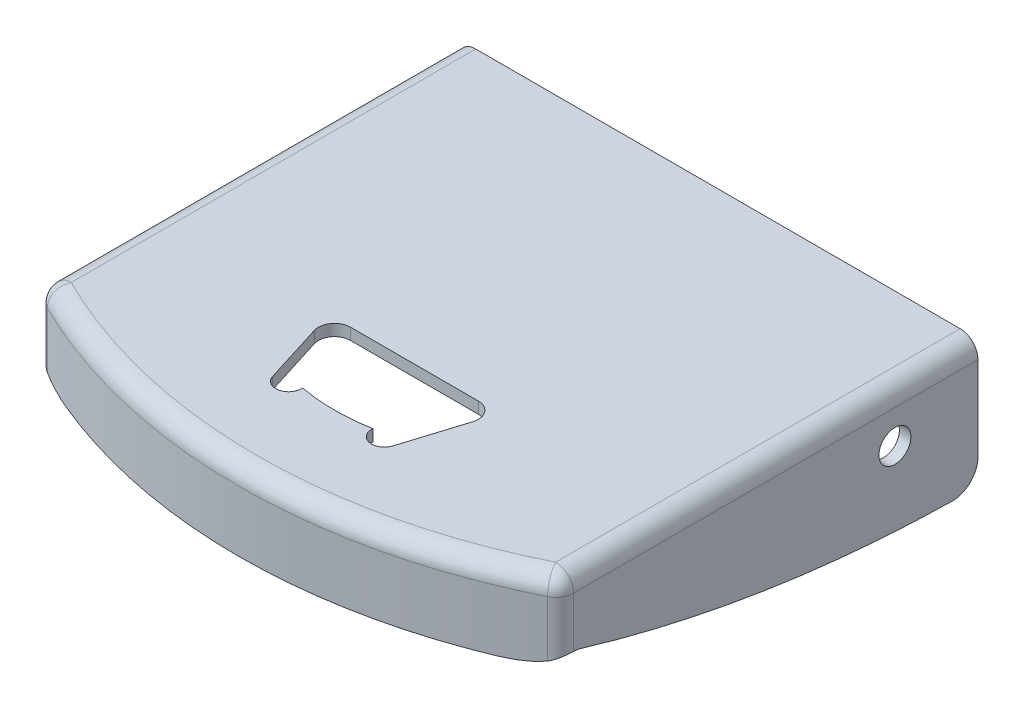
ISO-10303-21;
HEADER;
FILE_DESCRIPTION(('STEP AP214'),'2;1');
FILE_NAME('part.step','',(''),(''),'','','');
FILE_SCHEMA(('AUTOMOTIVE_DESIGN { 1 0 10303 214 1 1 1 1 }'));
ENDSEC;
DATA;
#1=APPLICATION_CONTEXT('core data for automotive mechanical design processes');
#2=APPLICATION_PROTOCOL_DEFINITION('international standard','automotive_design',2000,#1);
#3=PRODUCT_CONTEXT('',#1,'mechanical');
#4=PRODUCT('Part','Part','',(#3));
#5=PRODUCT_RELATED_PRODUCT_CATEGORY('part','',(#4));
#6=PRODUCT_DEFINITION_FORMATION('','',#4);
#7=PRODUCT_DEFINITION_CONTEXT('part definition',#1,'design');
#8=PRODUCT_DEFINITION('design','',#6,#7);
#9=PRODUCT_DEFINITION_SHAPE('','',#8);
#10=(LENGTH_UNIT() NAMED_UNIT(*) SI_UNIT(.MILLI.,.METRE.));
#11=(NAMED_UNIT(*) PLANE_ANGLE_UNIT() SI_UNIT($,.RADIAN.));
#12=(NAMED_UNIT(*) SI_UNIT($,.STERADIAN.) SOLID_ANGLE_UNIT());
#13=UNCERTAINTY_MEASURE_WITH_UNIT(LENGTH_MEASURE(1.E-05),#10,'distance_accuracy_value','');
#14=(GEOMETRIC_REPRESENTATION_CONTEXT(3) GLOBAL_UNCERTAINTY_ASSIGNED_CONTEXT((#13)) GLOBAL_UNIT_ASSIGNED_CONTEXT((#10,
#11,#12)) REPRESENTATION_CONTEXT('',''));
#15=CARTESIAN_POINT('',(0.,0.,0.));
#16=DIRECTION('',(0.,0.,1.));
#17=DIRECTION('',(1.,0.,0.));
#18=AXIS2_PLACEMENT_3D('',#15,#16,#17);
#19=CARTESIAN_POINT('',(0.,-20.,-12.8245));
#20=DIRECTION('',(0.,1.,0.));
#21=DIRECTION('',(0.,0.,1.));
#22=AXIS2_PLACEMENT_3D('',#19,#20,#21);
#23=CYLINDRICAL_SURFACE('',#22,87.8245);
#24=CARTESIAN_POINT('',(0.,-12.3041888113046,-12.8245));
#25=DIRECTION('',(0.,-1.,0.));
#26=DIRECTION('',(1.,0.,0.));
#27=AXIS2_PLACEMENT_3D('',#24,#25,#26);
#28=CIRCLE('',#27,87.8245);
#29=CARTESIAN_POINT('',(-33.9759887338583,-12.3041888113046,68.1617642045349));
#30=VERTEX_POINT('',#29);
#31=CARTESIAN_POINT('',(33.9759887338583,-12.3041888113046,68.1617642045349));
#32=VERTEX_POINT('',#31);
#33=EDGE_CURVE('E330',#30,#32,#28,.F.);
#34=ORIENTED_EDGE('',*,*,#33,.T.);
#35=CARTESIAN_POINT('',(33.9759887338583,-12.3041888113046,68.1617642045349));
#36=CARTESIAN_POINT('',(34.1980920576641,-12.3041715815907,68.068587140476));
#37=CARTESIAN_POINT('',(34.4198252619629,-12.3009316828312,67.974488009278));
#38=CARTESIAN_POINT('',(34.8623585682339,-12.2875045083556,67.784535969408));
#39=CARTESIAN_POINT('',(35.0831585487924,-12.2773163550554,67.6886828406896));
#40=CARTESIAN_POINT('',(35.522231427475,-12.2495753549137,67.4959271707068));
#41=CARTESIAN_POINT('',(35.7405115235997,-12.2320678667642,67.3990346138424));
#42=CARTESIAN_POINT('',(36.1756157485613,-12.1890634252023,67.2037729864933));
#43=CARTESIAN_POINT('',(36.3924399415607,-12.163566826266,67.1054039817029));
#44=CARTESIAN_POINT('',(36.8244669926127,-12.1037945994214,66.9072875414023));
#45=CARTESIAN_POINT('',(37.0396684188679,-12.069511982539,66.8075390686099));
#46=CARTESIAN_POINT('',(37.4677709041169,-11.9912370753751,66.6070101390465));
#47=CARTESIAN_POINT('',(37.6806724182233,-11.9472467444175,66.5062298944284));
#48=CARTESIAN_POINT('',(38.1049109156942,-11.8480673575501,66.3033342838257));
#49=CARTESIAN_POINT('',(38.3162305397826,-11.792811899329,66.2012145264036));
#50=CARTESIAN_POINT('',(38.6304303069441,-11.7004941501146,66.0478415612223));
#51=CARTESIAN_POINT('',(38.7347395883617,-11.6681349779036,65.9966654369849));
#52=CARTESIAN_POINT('',(38.9422762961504,-11.6000260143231,65.8943371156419));
#53=CARTESIAN_POINT('',(39.0455035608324,-11.5642757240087,65.8431849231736));
#54=CARTESIAN_POINT('',(39.1481108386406,-11.5267101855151,65.792089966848));
#55=B_SPLINE_CURVE_WITH_KNOTS('',3,(#35,#36,#37,#38,#39,#40,#41,#42,#43,#44,#45,#46,#47,#48,#49,
#50,#51,#52,#53,#54),.UNSPECIFIED.,.F.,.F.,(4,2,2,2,2,2,2,2,2,4),(0.,0.722569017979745,
1.44522931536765,2.16347608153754,2.88169098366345,3.60047898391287,4.3191220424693,
5.04213042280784,5.40391104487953,5.76574497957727),.UNSPECIFIED.);
#56=CARTESIAN_POINT('',(39.1481108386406,-11.5267101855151,65.792089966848));
#57=VERTEX_POINT('',#56);
#58=EDGE_CURVE('E356',#32,#57,#55,.T.);
#59=ORIENTED_EDGE('',*,*,#58,.T.);
#60=DIRECTION('',(0.,1.,0.));
#61=VECTOR('',#60,1.);
#62=CARTESIAN_POINT('',(39.1481108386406,-20.,65.792089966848));
#63=LINE('',#62,#61);
#64=CARTESIAN_POINT('',(39.1481108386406,-2.8,65.792089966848));
#65=VERTEX_POINT('',#64);
#66=EDGE_CURVE('E485',#57,#65,#63,.T.);
#67=ORIENTED_EDGE('',*,*,#66,.T.);
#68=CARTESIAN_POINT('',(0.,-2.8,-12.8245));
#69=DIRECTION('',(0.,1.,0.));
#70=DIRECTION('',(0.,0.,1.));
#71=AXIS2_PLACEMENT_3D('',#68,#69,#70);
#72=CIRCLE('',#71,87.8245);
#73=CARTESIAN_POINT('',(-39.1481108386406,-2.8,65.792089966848));
#74=VERTEX_POINT('',#73);
#75=EDGE_CURVE('E480',#65,#74,#72,.F.);
#76=ORIENTED_EDGE('',*,*,#75,.T.);
#77=DIRECTION('',(0.,1.,0.));
#78=VECTOR('',#77,1.);
#79=CARTESIAN_POINT('',(-39.1481108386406,-20.,65.792089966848));
#80=LINE('',#79,#78);
#81=CARTESIAN_POINT('',(-39.1481108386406,-11.526710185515,65.792089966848));
#82=VERTEX_POINT('',#81);
#83=EDGE_CURVE('E482',#74,#82,#80,.F.);
#84=ORIENTED_EDGE('',*,*,#83,.T.);
#85=CARTESIAN_POINT('',(-39.1481108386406,-11.526710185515,65.792089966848));
#86=CARTESIAN_POINT('',(-39.0455035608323,-11.5642757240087,65.8431849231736));
#87=CARTESIAN_POINT('',(-38.9422762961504,-11.6000260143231,65.8943371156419));
#88=CARTESIAN_POINT('',(-38.7347395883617,-11.6681349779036,65.9966654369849));
#89=CARTESIAN_POINT('',(-38.6304303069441,-11.7004941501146,66.0478415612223));
#90=CARTESIAN_POINT('',(-38.3162305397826,-11.792811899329,66.2012145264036));
#91=CARTESIAN_POINT('',(-38.1049109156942,-11.8480673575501,66.3033342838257));
#92=CARTESIAN_POINT('',(-37.6806724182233,-11.9472467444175,66.5062298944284));
#93=CARTESIAN_POINT('',(-37.4677709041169,-11.9912370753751,66.6070101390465));
#94=CARTESIAN_POINT('',(-37.0396684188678,-12.0695119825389,66.8075390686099));
#95=CARTESIAN_POINT('',(-36.8244669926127,-12.1037945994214,66.9072875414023));
#96=CARTESIAN_POINT('',(-36.3924399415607,-12.163566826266,67.1054039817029));
#97=CARTESIAN_POINT('',(-36.1756157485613,-12.1890634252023,67.2037729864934));
#98=CARTESIAN_POINT('',(-35.7405115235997,-12.2320678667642,67.3990346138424));
#99=CARTESIAN_POINT('',(-35.522231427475,-12.2495753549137,67.4959271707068));
#100=CARTESIAN_POINT('',(-35.0831585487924,-12.2773163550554,67.6886828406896));
#101=CARTESIAN_POINT('',(-34.8623585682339,-12.2875045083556,67.784535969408));
#102=CARTESIAN_POINT('',(-34.4198252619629,-12.3009316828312,67.974488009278));
#103=CARTESIAN_POINT('',(-34.1980920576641,-12.3041715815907,68.068587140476));
#104=CARTESIAN_POINT('',(-33.9759887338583,-12.3041888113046,68.1617642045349));
#105=B_SPLINE_CURVE_WITH_KNOTS('',3,(#85,#86,#87,#88,#89,#90,#91,#92,#93,#94,#95,#96,#97,#98,
#99,#100,#101,#102,#103,#104),.UNSPECIFIED.,.F.,.F.,(4,2,2,2,2,2,2,2,2,4),(0.,0.361833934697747,
0.723614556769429,1.44662293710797,2.16526599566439,2.88405399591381,3.60226889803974,
4.32051566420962,5.04317596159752,5.76574497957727),.UNSPECIFIED.);
#106=EDGE_CURVE('E349',#82,#30,#105,.T.);
#107=ORIENTED_EDGE('',*,*,#106,.T.);
#108=EDGE_LOOP('',(#34,#59,#67,#76,#84,#107));
#109=FACE_BOUND('',#108,.T.);
#110=ADVANCED_FACE('F40',(#109),#23,.T.);
#111=CARTESIAN_POINT('',(0.,-20.,-12.8245));
#112=DIRECTION('',(0.,1.,0.));
#113=DIRECTION('',(0.,0.,1.));
#114=AXIS2_PLACEMENT_3D('',#111,#112,#113);
#115=CYLINDRICAL_SURFACE('',#114,86.0245);
#116=CARTESIAN_POINT('',(38.9,-10.7321456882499,63.9023179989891));
#117=CARTESIAN_POINT('',(38.7029159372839,-10.746157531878,64.0022398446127));
#118=CARTESIAN_POINT('',(38.5056559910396,-10.7638681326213,64.1012933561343));
#119=CARTESIAN_POINT('',(38.1110074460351,-10.8066432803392,64.2975735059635));
#120=CARTESIAN_POINT('',(37.9136188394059,-10.8317083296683,64.3948000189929));
#121=CARTESIAN_POINT('',(37.5183839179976,-10.8892311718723,64.5876048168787));
#122=CARTESIAN_POINT('',(37.320537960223,-10.9217104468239,64.6831774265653));
#123=CARTESIAN_POINT('',(36.9252357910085,-10.9941092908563,64.8722796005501));
#124=CARTESIAN_POINT('',(36.7277795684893,-11.034028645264,64.9658092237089));
#125=CARTESIAN_POINT('',(36.3372931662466,-11.1206872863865,65.14896565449));
#126=CARTESIAN_POINT('',(36.1442500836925,-11.1672828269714,65.2386328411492));
#127=CARTESIAN_POINT('',(35.7591762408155,-11.2681774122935,65.4157762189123));
#128=CARTESIAN_POINT('',(35.5671454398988,-11.322476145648,65.5032524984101));
#129=CARTESIAN_POINT('',(35.1847631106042,-11.4392329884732,65.6757610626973));
#130=CARTESIAN_POINT('',(34.9944098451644,-11.5016812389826,65.7607961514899));
#131=CARTESIAN_POINT('',(34.615769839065,-11.6355399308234,65.928315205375));
#132=CARTESIAN_POINT('',(34.4274826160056,-11.7069482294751,66.0107997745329));
#133=CARTESIAN_POINT('',(34.148253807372,-11.8212055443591,66.1319533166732));
#134=CARTESIAN_POINT('',(34.056210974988,-11.8602471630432,66.17169636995));
#135=CARTESIAN_POINT('',(33.8729819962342,-11.9409798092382,66.2504368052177));
#136=CARTESIAN_POINT('',(33.7817957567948,-11.9826705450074,66.2894342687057));
#137=CARTESIAN_POINT('',(33.6000210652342,-12.0691130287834,66.3668062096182));
#138=CARTESIAN_POINT('',(33.5094373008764,-12.1138779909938,66.4051769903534));
#139=CARTESIAN_POINT('',(33.329508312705,-12.2065837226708,66.4810359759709));
#140=CARTESIAN_POINT('',(33.2401633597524,-12.2545251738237,66.5185239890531));
#141=CARTESIAN_POINT('',(33.1515642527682,-12.3041888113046,66.5555251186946));
#142=B_SPLINE_CURVE_WITH_KNOTS('',3,(#116,#117,#118,#119,#120,#121,#122,#123,#124,#125,#126,
#127,#128,#129,#130,#131,#132,#133,#134,#135,#136,#137,#138,#139,#140,#141),.UNSPECIFIED.,.F.,
.F.,(4,2,2,2,2,2,2,2,2,2,2,2,4),(0.,0.664198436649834,1.32844225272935,1.99463565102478,
2.66080983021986,3.31434615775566,3.96785607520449,4.62058260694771,5.27315334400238,
5.59589243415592,5.91859604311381,6.24278598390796,6.56704572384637),.UNSPECIFIED.);
#143=CARTESIAN_POINT('',(38.345753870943,-10.7812426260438,64.1808099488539));
#144=VERTEX_POINT('',#143);
#145=CARTESIAN_POINT('',(35.007608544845,-11.4988366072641,65.7546444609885));
#146=VERTEX_POINT('',#145);
#147=EDGE_CURVE('E394',#144,#146,#142,.T.);
#148=ORIENTED_EDGE('',*,*,#147,.T.);
#149=CARTESIAN_POINT('',(35.007608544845,-11.4988366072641,65.7546444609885));
#150=CARTESIAN_POINT('',(34.8881692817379,-11.538920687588,65.8078560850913));
#151=CARTESIAN_POINT('',(34.7680420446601,-11.5769262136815,65.8610467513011));
#152=CARTESIAN_POINT('',(34.5266008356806,-11.6490968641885,65.967287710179));
#153=CARTESIAN_POINT('',(34.4052870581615,-11.6832626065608,66.020338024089));
#154=CARTESIAN_POINT('',(34.0399858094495,-11.7804416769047,66.1790721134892));
#155=CARTESIAN_POINT('',(33.7944474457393,-11.8381997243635,66.2844241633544));
#156=CARTESIAN_POINT('',(33.3016236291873,-11.9413789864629,66.4931381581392));
#157=CARTESIAN_POINT('',(33.0543547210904,-11.9868650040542,66.596507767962));
#158=CARTESIAN_POINT('',(32.5573701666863,-12.0674175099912,66.8015291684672));
#159=CARTESIAN_POINT('',(32.3076540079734,-12.1024817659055,66.9031805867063));
#160=CARTESIAN_POINT('',(31.8065228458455,-12.1633423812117,67.1044219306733));
#161=CARTESIAN_POINT('',(31.5551093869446,-12.1891462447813,67.2040134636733));
#162=CARTESIAN_POINT('',(31.0507320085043,-12.2324830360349,67.4010567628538));
#163=CARTESIAN_POINT('',(30.797768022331,-12.2500156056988,67.4985084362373));
#164=CARTESIAN_POINT('',(30.2891910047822,-12.277675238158,67.691671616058));
#165=CARTESIAN_POINT('',(30.0335710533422,-12.2877611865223,67.7873706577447));
#166=CARTESIAN_POINT('',(29.5213012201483,-12.3010078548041,67.9763784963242));
#167=CARTESIAN_POINT('',(29.2646514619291,-12.304169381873,68.0696875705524));
#168=CARTESIAN_POINT('',(29.0075785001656,-12.3041888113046,68.1617642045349));
#169=B_SPLINE_CURVE_WITH_KNOTS('',3,(#149,#150,#151,#152,#153,#154,#155,#156,#157,#158,#159,
#160,#161,#162,#163,#164,#165,#166,#167,#168),.UNSPECIFIED.,.F.,.F.,(4,2,2,2,2,2,2,2,2,4),(0.,
0.410242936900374,0.820419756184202,1.64011930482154,2.45540169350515,3.27085859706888,
4.08565319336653,4.900483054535,5.71977879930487,6.53897903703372),.UNSPECIFIED.);
#170=CARTESIAN_POINT('',(29.0075785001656,-12.3041888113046,68.1617642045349));
#171=VERTEX_POINT('',#170);
#172=EDGE_CURVE('E447',#146,#171,#169,.T.);
#173=ORIENTED_EDGE('',*,*,#172,.T.);
#174=CARTESIAN_POINT('',(0.,-12.3041888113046,-12.8245));
#175=DIRECTION('',(0.,-1.,0.));
#176=DIRECTION('',(1.,0.,0.));
#177=AXIS2_PLACEMENT_3D('',#174,#175,#176);
#178=CIRCLE('',#177,86.0245);
#179=CARTESIAN_POINT('',(-29.0075785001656,-12.3041888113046,68.1617642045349));
#180=VERTEX_POINT('',#179);
#181=EDGE_CURVE('E327',#180,#171,#178,.F.);
#182=ORIENTED_EDGE('',*,*,#181,.F.);
#183=CARTESIAN_POINT('',(-29.0075785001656,-12.3041888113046,68.1617642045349));
#184=CARTESIAN_POINT('',(-29.2646514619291,-12.304169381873,68.0696875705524));
#185=CARTESIAN_POINT('',(-29.5213012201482,-12.3010078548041,67.9763784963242));
#186=CARTESIAN_POINT('',(-30.0335710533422,-12.2877611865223,67.7873706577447));
#187=CARTESIAN_POINT('',(-30.2891910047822,-12.277675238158,67.691671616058));
#188=CARTESIAN_POINT('',(-30.7977680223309,-12.2500156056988,67.4985084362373));
#189=CARTESIAN_POINT('',(-31.0507320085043,-12.2324830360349,67.4010567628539));
#190=CARTESIAN_POINT('',(-31.5551093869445,-12.1891462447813,67.2040134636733));
#191=CARTESIAN_POINT('',(-31.8065228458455,-12.1633423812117,67.1044219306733));
#192=CARTESIAN_POINT('',(-32.3076540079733,-12.1024817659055,66.9031805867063));
#193=CARTESIAN_POINT('',(-32.5573701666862,-12.0674175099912,66.8015291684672));
#194=CARTESIAN_POINT('',(-33.0543547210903,-11.9868650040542,66.596507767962));
#195=CARTESIAN_POINT('',(-33.3016236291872,-11.9413789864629,66.4931381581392));
#196=CARTESIAN_POINT('',(-33.7944474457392,-11.8381997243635,66.2844241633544));
#197=CARTESIAN_POINT('',(-34.0399858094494,-11.7804416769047,66.1790721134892));
#198=CARTESIAN_POINT('',(-34.4052870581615,-11.6832626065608,66.020338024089));
#199=CARTESIAN_POINT('',(-34.5266008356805,-11.6490968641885,65.967287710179));
#200=CARTESIAN_POINT('',(-34.7680420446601,-11.5769262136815,65.8610467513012));
#201=CARTESIAN_POINT('',(-34.8881692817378,-11.538920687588,65.8078560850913));
#202=CARTESIAN_POINT('',(-35.0076085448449,-11.4988366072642,65.7546444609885));
#203=B_SPLINE_CURVE_WITH_KNOTS('',3,(#183,#184,#185,#186,#187,#188,#189,#190,#191,#192,#193,
#194,#195,#196,#197,#198,#199,#200,#201,#202),.UNSPECIFIED.,.F.,.F.,(4,2,2,2,2,2,2,2,2,4),(0.,
0.819200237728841,1.63849598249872,2.45332584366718,3.26812043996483,4.08357734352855,
4.89885973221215,5.71855928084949,6.12873610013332,6.5389790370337),.UNSPECIFIED.);
#204=CARTESIAN_POINT('',(-35.0076085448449,-11.4988366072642,65.7546444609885));
#205=VERTEX_POINT('',#204);
#206=EDGE_CURVE('E453',#180,#205,#203,.T.);
#207=ORIENTED_EDGE('',*,*,#206,.T.);
#208=CARTESIAN_POINT('',(-33.1515642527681,-12.3041888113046,66.5555251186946));
#209=CARTESIAN_POINT('',(-33.2198616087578,-12.2658975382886,66.5270021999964));
#210=CARTESIAN_POINT('',(-33.28860619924,-12.2286364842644,66.4981886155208));
#211=CARTESIAN_POINT('',(-33.4268695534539,-12.1560402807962,66.4400230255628));
#212=CARTESIAN_POINT('',(-33.4963882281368,-12.1207049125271,66.4106710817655));
#213=CARTESIAN_POINT('',(-33.7058701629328,-12.0174114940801,66.3218954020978));
#214=CARTESIAN_POINT('',(-33.84683614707,-11.9521235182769,66.2617197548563));
#215=CARTESIAN_POINT('',(-34.1305201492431,-11.8279516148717,66.1397071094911));
#216=CARTESIAN_POINT('',(-34.2732349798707,-11.7690575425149,66.0778729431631));
#217=CARTESIAN_POINT('',(-34.5601973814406,-11.6569357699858,65.9526025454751));
#218=CARTESIAN_POINT('',(-34.7044451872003,-11.60370895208,65.8891660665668));
#219=CARTESIAN_POINT('',(-35.1356663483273,-11.452957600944,65.6980928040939));
#220=CARTESIAN_POINT('',(-35.424344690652,-11.362981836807,65.568305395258));
#221=CARTESIAN_POINT('',(-36.0044376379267,-11.2009345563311,65.3035796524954));
#222=CARTESIAN_POINT('',(-36.295853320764,-11.1288704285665,65.1686392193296));
#223=CARTESIAN_POINT('',(-36.7794105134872,-11.0234164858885,64.941394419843));
#224=CARTESIAN_POINT('',(-36.9711542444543,-10.9852573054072,64.8504228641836));
#225=CARTESIAN_POINT('',(-37.3549320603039,-10.9159565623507,64.6665891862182));
#226=CARTESIAN_POINT('',(-37.5469660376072,-10.884812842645,64.5737276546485));
#227=CARTESIAN_POINT('',(-37.9325551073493,-10.8292456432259,64.3854878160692));
#228=CARTESIAN_POINT('',(-38.1261109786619,-10.8048733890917,64.2900960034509));
#229=CARTESIAN_POINT('',(-38.5131674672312,-10.763194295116,64.0975210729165));
#230=CARTESIAN_POINT('',(-38.706668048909,-10.7458896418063,64.0003374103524));
#231=CARTESIAN_POINT('',(-38.9,-10.7321456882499,63.9023179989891));
#232=B_SPLINE_CURVE_WITH_KNOTS('',3,(#208,#209,#210,#211,#212,#213,#214,#215,#216,#217,#218,
#219,#220,#221,#222,#223,#224,#225,#226,#227,#228,#229,#230,#231),.UNSPECIFIED.,.F.,.F.,(4,2,2,
2,2,2,2,2,2,2,2,4),(0.,0.249977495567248,0.4999265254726,0.999544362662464,1.49835753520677,
1.99724824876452,2.98373140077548,3.97062080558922,4.61740585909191,5.26399176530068,
5.91534353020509,6.56689665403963),.UNSPECIFIED.);
#233=CARTESIAN_POINT('',(-38.3457538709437,-10.7812426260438,64.1808099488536));
#234=VERTEX_POINT('',#233);
#235=EDGE_CURVE('E469',#205,#234,#232,.T.);
#236=ORIENTED_EDGE('',*,*,#235,.T.);
#237=DIRECTION('',(0.,1.,0.));
#238=VECTOR('',#237,1.);
#239=CARTESIAN_POINT('',(-38.3457538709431,-20.,64.1808099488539));
#240=LINE('',#239,#238);
#241=CARTESIAN_POINT('',(-38.3457538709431,-2.8,64.1808099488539));
#242=VERTEX_POINT('',#241);
#243=EDGE_CURVE('E561',#234,#242,#240,.T.);
#244=ORIENTED_EDGE('',*,*,#243,.T.);
#245=CARTESIAN_POINT('',(0.,-2.8,-12.8245));
#246=DIRECTION('',(0.,1.,0.));
#247=DIRECTION('',(0.,0.,1.));
#248=AXIS2_PLACEMENT_3D('',#245,#246,#247);
#249=CIRCLE('',#248,86.0245);
#250=CARTESIAN_POINT('',(38.3457538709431,-2.8,64.1808099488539));
#251=VERTEX_POINT('',#250);
#252=EDGE_CURVE('E559',#242,#251,#249,.T.);
#253=ORIENTED_EDGE('',*,*,#252,.T.);
#254=DIRECTION('',(0.,1.,0.));
#255=VECTOR('',#254,1.);
#256=CARTESIAN_POINT('',(38.3457538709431,-20.,64.1808099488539));
#257=LINE('',#256,#255);
#258=EDGE_CURVE('E563',#251,#144,#257,.F.);
#259=ORIENTED_EDGE('',*,*,#258,.T.);
#260=EDGE_LOOP('',(#148,#173,#182,#207,#236,#244,#253,#259));
#261=FACE_BOUND('',#260,.T.);
#262=ADVANCED_FACE('F366',(#261),#115,.F.);
#263=CARTESIAN_POINT('',(40.7,196.25,0.));
#264=DIRECTION('',(-1.,0.,0.));
#265=DIRECTION('',(0.,0.,1.));
#266=AXIS2_PLACEMENT_3D('',#263,#264,#265);
#267=CYLINDRICAL_SURFACE('',#266,216.25);
#268=CARTESIAN_POINT('',(40.7,196.25,0.));
#269=DIRECTION('',(1.,0.,0.));
#270=DIRECTION('',(0.,0.,1.));
#271=AXIS2_PLACEMENT_3D('',#268,#269,#270);
#272=CIRCLE('',#271,216.25);
#273=CARTESIAN_POINT('',(40.7,-10.8625017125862,62.1970588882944));
#274=VERTEX_POINT('',#273);
#275=CARTESIAN_POINT('',(40.7,-19.9615948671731,4.075382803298));
#276=VERTEX_POINT('',#275);
#277=EDGE_CURVE('E725',#274,#276,#272,.T.);
#278=ORIENTED_EDGE('',*,*,#277,.F.);
#279=DIRECTION('',(-1.,0.,0.));
#280=VECTOR('',#279,1.);
#281=CARTESIAN_POINT('',(40.7,-10.8625017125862,62.1970588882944));
#282=LINE('',#281,#280);
#283=CARTESIAN_POINT('',(38.9,-10.8625017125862,62.1970588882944));
#284=VERTEX_POINT('',#283);
#285=EDGE_CURVE('E502',#274,#284,#282,.T.);
#286=ORIENTED_EDGE('',*,*,#285,.T.);
#287=CARTESIAN_POINT('',(38.9,196.25,0.));
#288=DIRECTION('',(1.,0.,0.));
#289=DIRECTION('',(0.,0.,-1.));
#290=AXIS2_PLACEMENT_3D('',#287,#288,#289);
#291=CIRCLE('',#290,216.25);
#292=CARTESIAN_POINT('',(38.9,-19.9615948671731,4.075382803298));
#293=VERTEX_POINT('',#292);
#294=EDGE_CURVE('E720',#284,#293,#291,.T.);
#295=ORIENTED_EDGE('',*,*,#294,.T.);
#296=DIRECTION('',(-1.,0.,0.));
#297=VECTOR('',#296,1.);
#298=CARTESIAN_POINT('',(40.7,-19.9615948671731,4.075382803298));
#299=LINE('',#298,#297);
#300=EDGE_CURVE('E732',#293,#276,#299,.F.);
#301=ORIENTED_EDGE('',*,*,#300,.T.);
#302=EDGE_LOOP('',(#278,#286,#295,#301));
#303=FACE_BOUND('',#302,.T.);
#304=ADVANCED_FACE('F382',(#303),#267,.T.);
#305=CARTESIAN_POINT('',(40.7,-20.,0.));
#306=DIRECTION('',(1.,0.,0.));
#307=DIRECTION('',(0.,0.,-1.));
#308=AXIS2_PLACEMENT_3D('',#305,#306,#307);
#309=PLANE('',#308);
#310=CARTESIAN_POINT('',(40.7,-8.,13.));
#311=DIRECTION('',(-1.,0.,0.));
#312=DIRECTION('',(0.,0.,1.));
#313=AXIS2_PLACEMENT_3D('',#310,#311,#312);
#314=CIRCLE('',#313,2.5);
#315=CARTESIAN_POINT('',(40.7,-8.,15.5));
#316=VERTEX_POINT('',#315);
#317=EDGE_CURVE('E319',#316,#316,#314,.T.);
#318=ORIENTED_EDGE('',*,*,#317,.T.);
#319=EDGE_LOOP('',(#318));
#320=FACE_BOUND('',#319,.T.);
#321=DIRECTION('',(0.,0.,-1.));
#322=VECTOR('',#321,1.);
#323=CARTESIAN_POINT('',(40.7,-2.8,0.));
#324=LINE('',#323,#322);
#325=CARTESIAN_POINT('',(40.7,-2.80000000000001,0.));
#326=VERTEX_POINT('',#325);
#327=CARTESIAN_POINT('',(40.7,-2.8,63.2856543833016));
#328=VERTEX_POINT('',#327);
#329=EDGE_CURVE('E486',#326,#328,#324,.F.);
#330=ORIENTED_EDGE('',*,*,#329,.T.);
#331=DIRECTION('',(0.,1.,0.));
#332=VECTOR('',#331,1.);
#333=CARTESIAN_POINT('',(40.7,-20.,63.2856543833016));
#334=LINE('',#333,#332);
#335=CARTESIAN_POINT('',(40.7,-10.6939629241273,63.2856543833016));
#336=VERTEX_POINT('',#335);
#337=EDGE_CURVE('E414',#328,#336,#334,.F.);
#338=ORIENTED_EDGE('',*,*,#337,.T.);
#339=CARTESIAN_POINT('',(40.7,-14.6934844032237,63.3475247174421));
#340=DIRECTION('',(1.,0.,0.));
#341=DIRECTION('',(0.,0.,-1.));
#342=AXIS2_PLACEMENT_3D('',#339,#340,#341);
#343=CIRCLE('',#342,4.);
#344=EDGE_CURVE('E494',#336,#274,#343,.F.);
#345=ORIENTED_EDGE('',*,*,#344,.T.);
#346=ORIENTED_EDGE('',*,*,#277,.T.);
#347=CARTESIAN_POINT('',(40.7,-15.9623052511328,4.));
#348=DIRECTION('',(1.,0.,0.));
#349=DIRECTION('',(0.,0.,-1.));
#350=AXIS2_PLACEMENT_3D('',#347,#348,#349);
#351=CIRCLE('',#350,4.);
#352=CARTESIAN_POINT('',(40.7,-15.9623052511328,0.));
#353=VERTEX_POINT('',#352);
#354=EDGE_CURVE('E689',#276,#353,#351,.T.);
#355=ORIENTED_EDGE('',*,*,#354,.T.);
#356=DIRECTION('',(0.,1.,0.));
#357=VECTOR('',#356,1.);
#358=CARTESIAN_POINT('',(40.7,-20.,0.));
#359=LINE('',#358,#357);
#360=EDGE_CURVE('E729',#353,#326,#359,.T.);
#361=ORIENTED_EDGE('',*,*,#360,.T.);
#362=EDGE_LOOP('',(#330,#338,#345,#346,#355,#361));
#363=FACE_BOUND('',#362,.T.);
#364=ADVANCED_FACE('F375',(#320,#363),#309,.T.);
#365=CARTESIAN_POINT('',(-40.7,-20.,0.));
#366=DIRECTION('',(-1.,0.,0.));
#367=DIRECTION('',(0.,0.,1.));
#368=AXIS2_PLACEMENT_3D('',#365,#366,#367);
#369=PLANE('',#368);
#370=CARTESIAN_POINT('',(-40.7,-8.,13.));
#371=DIRECTION('',(-1.,0.,0.));
#372=DIRECTION('',(0.,0.,1.));
#373=AXIS2_PLACEMENT_3D('',#370,#371,#372);
#374=CIRCLE('',#373,2.5);
#375=CARTESIAN_POINT('',(-40.7,-8.,15.5));
#376=VERTEX_POINT('',#375);
#377=EDGE_CURVE('E307',#376,#376,#374,.T.);
#378=ORIENTED_EDGE('',*,*,#377,.F.);
#379=EDGE_LOOP('',(#378));
#380=FACE_BOUND('',#379,.T.);
#381=CARTESIAN_POINT('',(-40.7,-14.6934844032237,63.3475247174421));
#382=DIRECTION('',(-1.,0.,0.));
#383=DIRECTION('',(0.,0.,1.));
#384=AXIS2_PLACEMENT_3D('',#381,#382,#383);
#385=CIRCLE('',#384,4.);
#386=CARTESIAN_POINT('',(-40.7,-10.8625017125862,62.1970588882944));
#387=VERTEX_POINT('',#386);
#388=CARTESIAN_POINT('',(-40.7,-10.6939629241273,63.2856543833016));
#389=VERTEX_POINT('',#388);
#390=EDGE_CURVE('E478',#387,#389,#385,.F.);
#391=ORIENTED_EDGE('',*,*,#390,.T.);
#392=DIRECTION('',(0.,1.,0.));
#393=VECTOR('',#392,1.);
#394=CARTESIAN_POINT('',(-40.7,-20.,63.2856543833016));
#395=LINE('',#394,#393);
#396=CARTESIAN_POINT('',(-40.7,-2.8,63.2856543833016));
#397=VERTEX_POINT('',#396);
#398=EDGE_CURVE('E647',#389,#397,#395,.T.);
#399=ORIENTED_EDGE('',*,*,#398,.T.);
#400=DIRECTION('',(0.,0.,1.));
#401=VECTOR('',#400,1.);
#402=CARTESIAN_POINT('',(-40.7,-2.8,0.));
#403=LINE('',#402,#401);
#404=CARTESIAN_POINT('',(-40.7,-2.80000000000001,0.));
#405=VERTEX_POINT('',#404);
#406=EDGE_CURVE('E649',#397,#405,#403,.F.);
#407=ORIENTED_EDGE('',*,*,#406,.T.);
#408=DIRECTION('',(0.,1.,0.));
#409=VECTOR('',#408,1.);
#410=CARTESIAN_POINT('',(-40.7,-20.,0.));
#411=LINE('',#410,#409);
#412=CARTESIAN_POINT('',(-40.7,-15.9623052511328,0.));
#413=VERTEX_POINT('',#412);
#414=EDGE_CURVE('E730',#413,#405,#411,.T.);
#415=ORIENTED_EDGE('',*,*,#414,.F.);
#416=CARTESIAN_POINT('',(-40.7,-15.9623052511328,4.00000000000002));
#417=DIRECTION('',(-1.,0.,0.));
#418=DIRECTION('',(0.,0.,1.));
#419=AXIS2_PLACEMENT_3D('',#416,#417,#418);
#420=CIRCLE('',#419,4.);
#421=CARTESIAN_POINT('',(-40.7,-19.9615948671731,4.07538280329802));
#422=VERTEX_POINT('',#421);
#423=EDGE_CURVE('E685',#413,#422,#420,.T.);
#424=ORIENTED_EDGE('',*,*,#423,.T.);
#425=CARTESIAN_POINT('',(-40.7,196.25,0.));
#426=DIRECTION('',(1.,0.,0.));
#427=DIRECTION('',(0.,0.,1.));
#428=AXIS2_PLACEMENT_3D('',#425,#426,#427);
#429=CIRCLE('',#428,216.25);
#430=EDGE_CURVE('E674',#387,#422,#429,.T.);
#431=ORIENTED_EDGE('',*,*,#430,.F.);
#432=EDGE_LOOP('',(#391,#399,#407,#415,#424,#431));
#433=FACE_BOUND('',#432,.T.);
#434=ADVANCED_FACE('F370',(#380,#433),#369,.T.);
#435=CARTESIAN_POINT('',(-40.7,-20.,0.));
#436=DIRECTION('',(0.,0.,-1.));
#437=DIRECTION('',(-1.,0.,0.));
#438=AXIS2_PLACEMENT_3D('',#435,#436,#437);
#439=PLANE('',#438);
#440=DIRECTION('',(-1.,0.,0.));
#441=VECTOR('',#440,1.);
#442=CARTESIAN_POINT('',(-40.7,0.,0.));
#443=LINE('',#442,#441);
#444=CARTESIAN_POINT('',(37.9,0.,0.));
#445=VERTEX_POINT('',#444);
#446=CARTESIAN_POINT('',(-37.9,0.,0.));
#447=VERTEX_POINT('',#446);
#448=EDGE_CURVE('E662',#445,#447,#443,.T.);
#449=ORIENTED_EDGE('',*,*,#448,.F.);
#450=CARTESIAN_POINT('',(37.9,-2.8,0.));
#451=DIRECTION('',(0.,0.,-1.));
#452=DIRECTION('',(-1.,0.,0.));
#453=AXIS2_PLACEMENT_3D('',#450,#451,#452);
#454=CIRCLE('',#453,2.8);
#455=EDGE_CURVE('E651',#445,#326,#454,.T.);
#456=ORIENTED_EDGE('',*,*,#455,.T.);
#457=ORIENTED_EDGE('',*,*,#360,.F.);
#458=DIRECTION('',(1.,0.,0.));
#459=VECTOR('',#458,1.);
#460=CARTESIAN_POINT('',(38.9,-15.9623052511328,0.));
#461=LINE('',#460,#459);
#462=CARTESIAN_POINT('',(38.9,-15.9623052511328,0.));
#463=VERTEX_POINT('',#462);
#464=EDGE_CURVE('E712',#353,#463,#461,.F.);
#465=ORIENTED_EDGE('',*,*,#464,.T.);
#466=DIRECTION('',(0.,1.,0.));
#467=VECTOR('',#466,1.);
#468=CARTESIAN_POINT('',(38.9,-26.8,0.));
#469=LINE('',#468,#467);
#470=CARTESIAN_POINT('',(38.9,-2.8,0.));
#471=VERTEX_POINT('',#470);
#472=EDGE_CURVE('E705',#463,#471,#469,.T.);
#473=ORIENTED_EDGE('',*,*,#472,.T.);
#474=CARTESIAN_POINT('',(37.9,-2.8,0.));
#475=DIRECTION('',(0.,0.,-1.));
#476=DIRECTION('',(-1.,0.,0.));
#477=AXIS2_PLACEMENT_3D('',#474,#475,#476);
#478=CIRCLE('',#477,1.);
#479=CARTESIAN_POINT('',(37.9,-1.8,0.));
#480=VERTEX_POINT('',#479);
#481=EDGE_CURVE('E346',#471,#480,#478,.F.);
#482=ORIENTED_EDGE('',*,*,#481,.T.);
#483=DIRECTION('',(-1.,0.,0.));
#484=VECTOR('',#483,1.);
#485=CARTESIAN_POINT('',(38.9,-1.8,0.));
#486=LINE('',#485,#484);
#487=CARTESIAN_POINT('',(-37.9,-1.8,0.));
#488=VERTEX_POINT('',#487);
#489=EDGE_CURVE('E713',#480,#488,#486,.T.);
#490=ORIENTED_EDGE('',*,*,#489,.T.);
#491=CARTESIAN_POINT('',(-37.9,-2.8,0.));
#492=DIRECTION('',(0.,0.,-1.));
#493=DIRECTION('',(-1.,0.,0.));
#494=AXIS2_PLACEMENT_3D('',#491,#492,#493);
#495=CIRCLE('',#494,1.);
#496=CARTESIAN_POINT('',(-38.9,-2.8,0.));
#497=VERTEX_POINT('',#496);
#498=EDGE_CURVE('E620',#488,#497,#495,.F.);
#499=ORIENTED_EDGE('',*,*,#498,.T.);
#500=DIRECTION('',(0.,-1.,0.));
#501=VECTOR('',#500,1.);
#502=CARTESIAN_POINT('',(-38.9,-1.8,0.));
#503=LINE('',#502,#501);
#504=CARTESIAN_POINT('',(-38.9,-15.9623052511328,0.));
#505=VERTEX_POINT('',#504);
#506=EDGE_CURVE('E333',#497,#505,#503,.T.);
#507=ORIENTED_EDGE('',*,*,#506,.T.);
#508=DIRECTION('',(1.,0.,0.));
#509=VECTOR('',#508,1.);
#510=CARTESIAN_POINT('',(-40.7,-15.9623052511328,0.));
#511=LINE('',#510,#509);
#512=EDGE_CURVE('E736',#505,#413,#511,.F.);
#513=ORIENTED_EDGE('',*,*,#512,.T.);
#514=ORIENTED_EDGE('',*,*,#414,.T.);
#515=CARTESIAN_POINT('',(-37.9,-2.8,0.));
#516=DIRECTION('',(0.,0.,-1.));
#517=DIRECTION('',(-1.,0.,0.));
#518=AXIS2_PLACEMENT_3D('',#515,#516,#517);
#519=CIRCLE('',#518,2.8);
#520=EDGE_CURVE('E653',#405,#447,#519,.T.);
#521=ORIENTED_EDGE('',*,*,#520,.T.);
#522=EDGE_LOOP('',(#449,#456,#457,#465,#473,#482,#490,#499,#507,#513,#514,#521));
#523=FACE_BOUND('',#522,.T.);
#524=ADVANCED_FACE('F374',(#523),#439,.T.);
#525=CARTESIAN_POINT('',(0.,0.,-12.8245));
#526=DIRECTION('',(0.,1.,0.));
#527=DIRECTION('',(0.,0.,1.));
#528=AXIS2_PLACEMENT_3D('',#525,#526,#527);
#529=PLANE('',#528);
#530=CARTESIAN_POINT('',(7.49999999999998,0.,59.6824583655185));
#531=DIRECTION('',(0.,1.,0.));
#532=DIRECTION('',(0.,0.,-1.));
#533=AXIS2_PLACEMENT_3D('',#530,#531,#532);
#534=CIRCLE('',#533,2.);
#535=CARTESIAN_POINT('',(5.50930210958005,0.,59.4897878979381));
#536=VERTEX_POINT('',#535);
#537=CARTESIAN_POINT('',(9.40906954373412,0.,60.2786575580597));
#538=VERTEX_POINT('',#537);
#539=EDGE_CURVE('E57',#536,#538,#534,.T.);
#540=ORIENTED_EDGE('',*,*,#539,.F.);
#541=CARTESIAN_POINT('',(0.,0.,30.));
#542=DIRECTION('',(0.,1.,0.));
#543=DIRECTION('',(0.,0.,1.));
#544=AXIS2_PLACEMENT_3D('',#541,#542,#543);
#545=CIRCLE('',#544,30.);
#546=CARTESIAN_POINT('',(-5.50930210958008,0.,59.4897878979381));
#547=VERTEX_POINT('',#546);
#548=EDGE_CURVE('E269',#547,#536,#545,.T.);
#549=ORIENTED_EDGE('',*,*,#548,.F.);
#550=CARTESIAN_POINT('',(-7.49999999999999,0.,59.6824583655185));
#551=DIRECTION('',(0.,1.,0.));
#552=DIRECTION('',(0.,0.,1.));
#553=AXIS2_PLACEMENT_3D('',#550,#551,#552);
#554=CIRCLE('',#553,2.);
#555=CARTESIAN_POINT('',(-9.40906954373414,0.,60.2786575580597));
#556=VERTEX_POINT('',#555);
#557=EDGE_CURVE('E272',#556,#547,#554,.T.);
#558=ORIENTED_EDGE('',*,*,#557,.F.);
#559=DIRECTION('',(0.298099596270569,0.,0.954534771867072));
#560=VECTOR('',#559,1.);
#561=CARTESIAN_POINT('',(-9.40906954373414,0.,60.2786575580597));
#562=LINE('',#561,#560);
#563=CARTESIAN_POINT('',(-12.3863369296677,0.,50.7452489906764));
#564=VERTEX_POINT('',#563);
#565=EDGE_CURVE('E300',#564,#556,#562,.T.);
#566=ORIENTED_EDGE('',*,*,#565,.F.);
#567=CARTESIAN_POINT('',(-9.99999999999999,0.,50.));
#568=DIRECTION('',(0.,1.,0.));
#569=DIRECTION('',(0.,0.,1.));
#570=AXIS2_PLACEMENT_3D('',#567,#568,#569);
#571=CIRCLE('',#570,2.5);
#572=CARTESIAN_POINT('',(-9.99999999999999,0.,47.5));
#573=VERTEX_POINT('',#572);
#574=EDGE_CURVE('E297',#573,#564,#571,.T.);
#575=ORIENTED_EDGE('',*,*,#574,.F.);
#576=DIRECTION('',(-1.,0.,0.));
#577=VECTOR('',#576,1.);
#578=CARTESIAN_POINT('',(-9.99999999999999,0.,47.5));
#579=LINE('',#578,#577);
#580=CARTESIAN_POINT('',(9.99999999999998,0.,47.5));
#581=VERTEX_POINT('',#580);
#582=EDGE_CURVE('E294',#581,#573,#579,.T.);
#583=ORIENTED_EDGE('',*,*,#582,.F.);
#584=CARTESIAN_POINT('',(9.99999999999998,0.,50.));
#585=DIRECTION('',(0.,1.,0.));
#586=DIRECTION('',(0.,0.,-1.));
#587=AXIS2_PLACEMENT_3D('',#584,#585,#586);
#588=CIRCLE('',#587,2.49999999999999);
#589=CARTESIAN_POINT('',(12.3863369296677,0.,50.7452489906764));
#590=VERTEX_POINT('',#589);
#591=EDGE_CURVE('E291',#590,#581,#588,.T.);
#592=ORIENTED_EDGE('',*,*,#591,.F.);
#593=DIRECTION('',(0.298099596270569,0.,-0.954534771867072));
#594=VECTOR('',#593,1.);
#595=CARTESIAN_POINT('',(9.40906954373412,0.,60.2786575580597));
#596=LINE('',#595,#594);
#597=EDGE_CURVE('E289',#538,#590,#596,.T.);
#598=ORIENTED_EDGE('',*,*,#597,.F.);
#599=EDGE_LOOP('',(#540,#549,#558,#566,#575,#583,#592,#598));
#600=FACE_BOUND('',#599,.T.);
#601=CARTESIAN_POINT('',(0.,0.,-12.8245));
#602=DIRECTION('',(0.,1.,0.));
#603=DIRECTION('',(0.,0.,1.));
#604=AXIS2_PLACEMENT_3D('',#601,#602,#603);
#605=CIRCLE('',#604,85.0245);
#606=CARTESIAN_POINT('',(-37.9,0.,63.2856543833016));
#607=VERTEX_POINT('',#606);
#608=CARTESIAN_POINT('',(37.9,0.,63.2856543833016));
#609=VERTEX_POINT('',#608);
#610=EDGE_CURVE('E542',#607,#609,#605,.T.);
#611=ORIENTED_EDGE('',*,*,#610,.T.);
#612=DIRECTION('',(0.,0.,-1.));
#613=VECTOR('',#612,1.);
#614=CARTESIAN_POINT('',(37.9,0.,-12.8245));
#615=LINE('',#614,#613);
#616=EDGE_CURVE('E655',#609,#445,#615,.T.);
#617=ORIENTED_EDGE('',*,*,#616,.T.);
#618=ORIENTED_EDGE('',*,*,#448,.T.);
#619=DIRECTION('',(0.,0.,1.));
#620=VECTOR('',#619,1.);
#621=CARTESIAN_POINT('',(-37.9,0.,-12.8245));
#622=LINE('',#621,#620);
#623=EDGE_CURVE('E413',#447,#607,#622,.T.);
#624=ORIENTED_EDGE('',*,*,#623,.T.);
#625=EDGE_LOOP('',(#611,#617,#618,#624));
#626=FACE_BOUND('',#625,.T.);
#627=ADVANCED_FACE('F368',(#600,#626),#529,.T.);
#628=ORIENTED_EDGE('',*,*,#430,.T.);
#629=DIRECTION('',(-1.,0.,0.));
#630=VECTOR('',#629,1.);
#631=CARTESIAN_POINT('',(40.7,-19.9615948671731,4.075382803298));
#632=LINE('',#631,#630);
#633=CARTESIAN_POINT('',(-38.9,-19.9615948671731,4.07538280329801));
#634=VERTEX_POINT('',#633);
#635=EDGE_CURVE('E684',#422,#634,#632,.F.);
#636=ORIENTED_EDGE('',*,*,#635,.T.);
#637=CARTESIAN_POINT('',(-38.9,196.25,0.));
#638=DIRECTION('',(-1.,0.,0.));
#639=DIRECTION('',(0.,0.,1.));
#640=AXIS2_PLACEMENT_3D('',#637,#638,#639);
#641=CIRCLE('',#640,216.25);
#642=CARTESIAN_POINT('',(-38.9,-10.8625017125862,62.1970588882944));
#643=VERTEX_POINT('',#642);
#644=EDGE_CURVE('E683',#643,#634,#641,.F.);
#645=ORIENTED_EDGE('',*,*,#644,.F.);
#646=DIRECTION('',(-1.,0.,0.));
#647=VECTOR('',#646,1.);
#648=CARTESIAN_POINT('',(40.7,-10.8625017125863,62.1970588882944));
#649=LINE('',#648,#647);
#650=EDGE_CURVE('E677',#643,#387,#649,.T.);
#651=ORIENTED_EDGE('',*,*,#650,.T.);
#652=EDGE_LOOP('',(#628,#636,#645,#651));
#653=FACE_BOUND('',#652,.T.);
#654=ADVANCED_FACE('F680',(#653),#267,.T.);
#655=CARTESIAN_POINT('',(38.9,-20.,0.));
#656=DIRECTION('',(1.,0.,0.));
#657=DIRECTION('',(0.,0.,-1.));
#658=AXIS2_PLACEMENT_3D('',#655,#656,#657);
#659=PLANE('',#658);
#660=CARTESIAN_POINT('',(38.9,-8.,13.));
#661=DIRECTION('',(1.,0.,0.));
#662=DIRECTION('',(0.,0.,-1.));
#663=AXIS2_PLACEMENT_3D('',#660,#661,#662);
#664=CIRCLE('',#663,2.5);
#665=CARTESIAN_POINT('',(38.9,-8.,10.5));
#666=VERTEX_POINT('',#665);
#667=EDGE_CURVE('E324',#666,#666,#664,.T.);
#668=ORIENTED_EDGE('',*,*,#667,.T.);
#669=EDGE_LOOP('',(#668));
#670=FACE_BOUND('',#669,.T.);
#671=CARTESIAN_POINT('',(38.9,-14.6934844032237,63.3475247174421));
#672=DIRECTION('',(1.,0.,0.));
#673=DIRECTION('',(0.,0.,-1.));
#674=AXIS2_PLACEMENT_3D('',#671,#672,#673);
#675=CIRCLE('',#674,4.);
#676=CARTESIAN_POINT('',(38.9,-10.6939629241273,63.2856543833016));
#677=VERTEX_POINT('',#676);
#678=EDGE_CURVE('E694',#284,#677,#675,.T.);
#679=ORIENTED_EDGE('',*,*,#678,.T.);
#680=DIRECTION('',(0.,-1.,0.));
#681=VECTOR('',#680,1.);
#682=CARTESIAN_POINT('',(38.9,-1.80000000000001,63.2856543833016));
#683=LINE('',#682,#681);
#684=CARTESIAN_POINT('',(38.9,-2.8,63.2856543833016));
#685=VERTEX_POINT('',#684);
#686=EDGE_CURVE('E556',#677,#685,#683,.F.);
#687=ORIENTED_EDGE('',*,*,#686,.T.);
#688=DIRECTION('',(0.,0.,-1.));
#689=VECTOR('',#688,1.);
#690=CARTESIAN_POINT('',(38.9,-2.8,0.));
#691=LINE('',#690,#689);
#692=EDGE_CURVE('E554',#685,#471,#691,.T.);
#693=ORIENTED_EDGE('',*,*,#692,.T.);
#694=ORIENTED_EDGE('',*,*,#472,.F.);
#695=CARTESIAN_POINT('',(38.9,-15.9623052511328,4.));
#696=DIRECTION('',(1.,0.,0.));
#697=DIRECTION('',(0.,0.,-1.));
#698=AXIS2_PLACEMENT_3D('',#695,#696,#697);
#699=CIRCLE('',#698,4.);
#700=EDGE_CURVE('E740',#463,#293,#699,.F.);
#701=ORIENTED_EDGE('',*,*,#700,.T.);
#702=ORIENTED_EDGE('',*,*,#294,.F.);
#703=EDGE_LOOP('',(#679,#687,#693,#694,#701,#702));
#704=FACE_BOUND('',#703,.T.);
#705=ADVANCED_FACE('F464',(#670,#704),#659,.F.);
#706=CARTESIAN_POINT('',(-38.9,-20.,0.));
#707=DIRECTION('',(-1.,0.,0.));
#708=DIRECTION('',(0.,0.,1.));
#709=AXIS2_PLACEMENT_3D('',#706,#707,#708);
#710=PLANE('',#709);
#711=CARTESIAN_POINT('',(-38.9,-8.,13.));
#712=DIRECTION('',(-1.,0.,0.));
#713=DIRECTION('',(0.,0.,1.));
#714=AXIS2_PLACEMENT_3D('',#711,#712,#713);
#715=CIRCLE('',#714,2.5);
#716=CARTESIAN_POINT('',(-38.9,-8.,15.5));
#717=VERTEX_POINT('',#716);
#718=EDGE_CURVE('E45',#717,#717,#715,.T.);
#719=ORIENTED_EDGE('',*,*,#718,.T.);
#720=EDGE_LOOP('',(#719));
#721=FACE_BOUND('',#720,.T.);
#722=DIRECTION('',(0.,0.,1.));
#723=VECTOR('',#722,1.);
#724=CARTESIAN_POINT('',(-38.9,-2.8,63.9023179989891));
#725=LINE('',#724,#723);
#726=CARTESIAN_POINT('',(-38.9,-2.8,63.2856543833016));
#727=VERTEX_POINT('',#726);
#728=EDGE_CURVE('E565',#497,#727,#725,.T.);
#729=ORIENTED_EDGE('',*,*,#728,.T.);
#730=DIRECTION('',(0.,-1.,0.));
#731=VECTOR('',#730,1.);
#732=CARTESIAN_POINT('',(-38.9,-10.7321456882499,63.2856543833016));
#733=LINE('',#732,#731);
#734=CARTESIAN_POINT('',(-38.9,-10.6939629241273,63.2856543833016));
#735=VERTEX_POINT('',#734);
#736=EDGE_CURVE('E567',#727,#735,#733,.T.);
#737=ORIENTED_EDGE('',*,*,#736,.T.);
#738=CARTESIAN_POINT('',(-38.9,-14.6934844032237,63.3475247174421));
#739=DIRECTION('',(-1.,0.,0.));
#740=DIRECTION('',(0.,0.,1.));
#741=AXIS2_PLACEMENT_3D('',#738,#739,#740);
#742=CIRCLE('',#741,4.);
#743=EDGE_CURVE('E477',#735,#643,#742,.T.);
#744=ORIENTED_EDGE('',*,*,#743,.T.);
#745=ORIENTED_EDGE('',*,*,#644,.T.);
#746=CARTESIAN_POINT('',(-38.9,-15.9623052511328,4.00000000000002));
#747=DIRECTION('',(-1.,0.,0.));
#748=DIRECTION('',(0.,0.,1.));
#749=AXIS2_PLACEMENT_3D('',#746,#747,#748);
#750=CIRCLE('',#749,4.);
#751=EDGE_CURVE('E687',#634,#505,#750,.F.);
#752=ORIENTED_EDGE('',*,*,#751,.T.);
#753=ORIENTED_EDGE('',*,*,#506,.F.);
#754=EDGE_LOOP('',(#729,#737,#744,#745,#752,#753));
#755=FACE_BOUND('',#754,.T.);
#756=ADVANCED_FACE('F755',(#721,#755),#710,.F.);
#757=CARTESIAN_POINT('',(0.,-1.8,-12.8245));
#758=DIRECTION('',(0.,1.,0.));
#759=DIRECTION('',(0.,0.,1.));
#760=AXIS2_PLACEMENT_3D('',#757,#758,#759);
#761=PLANE('',#760);
#762=CARTESIAN_POINT('',(0.,-1.8,30.));
#763=DIRECTION('',(0.,1.,0.));
#764=DIRECTION('',(0.,0.,1.));
#765=AXIS2_PLACEMENT_3D('',#762,#763,#764);
#766=CIRCLE('',#765,30.);
#767=CARTESIAN_POINT('',(-5.50930210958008,-1.8,59.4897878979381));
#768=VERTEX_POINT('',#767);
#769=CARTESIAN_POINT('',(5.50930210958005,-1.8,59.4897878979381));
#770=VERTEX_POINT('',#769);
#771=EDGE_CURVE('E258',#768,#770,#766,.T.);
#772=ORIENTED_EDGE('',*,*,#771,.T.);
#773=CARTESIAN_POINT('',(7.49999999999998,-1.8,59.6824583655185));
#774=DIRECTION('',(0.,1.,0.));
#775=DIRECTION('',(0.,0.,-1.));
#776=AXIS2_PLACEMENT_3D('',#773,#774,#775);
#777=CIRCLE('',#776,2.);
#778=CARTESIAN_POINT('',(9.40906954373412,-1.8,60.2786575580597));
#779=VERTEX_POINT('',#778);
#780=EDGE_CURVE('E252',#770,#779,#777,.T.);
#781=ORIENTED_EDGE('',*,*,#780,.T.);
#782=DIRECTION('',(0.298099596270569,0.,-0.954534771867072));
#783=VECTOR('',#782,1.);
#784=CARTESIAN_POINT('',(9.40906954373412,-1.8,60.2786575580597));
#785=LINE('',#784,#783);
#786=CARTESIAN_POINT('',(12.3863369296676,-1.8,50.7452489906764));
#787=VERTEX_POINT('',#786);
#788=EDGE_CURVE('E261',#779,#787,#785,.T.);
#789=ORIENTED_EDGE('',*,*,#788,.T.);
#790=CARTESIAN_POINT('',(9.99999999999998,-1.8,50.));
#791=DIRECTION('',(0.,1.,0.));
#792=DIRECTION('',(0.,0.,-1.));
#793=AXIS2_PLACEMENT_3D('',#790,#791,#792);
#794=CIRCLE('',#793,2.49999999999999);
#795=CARTESIAN_POINT('',(9.99999999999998,-1.8,47.5));
#796=VERTEX_POINT('',#795);
#797=EDGE_CURVE('E65',#787,#796,#794,.T.);
#798=ORIENTED_EDGE('',*,*,#797,.T.);
#799=DIRECTION('',(-1.,0.,0.));
#800=VECTOR('',#799,1.);
#801=CARTESIAN_POINT('',(-9.99999999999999,-1.8,47.5));
#802=LINE('',#801,#800);
#803=CARTESIAN_POINT('',(-9.99999999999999,-1.8,47.5));
#804=VERTEX_POINT('',#803);
#805=EDGE_CURVE('E276',#796,#804,#802,.T.);
#806=ORIENTED_EDGE('',*,*,#805,.T.);
#807=CARTESIAN_POINT('',(-9.99999999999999,-1.8,50.));
#808=DIRECTION('',(0.,1.,0.));
#809=DIRECTION('',(0.,0.,1.));
#810=AXIS2_PLACEMENT_3D('',#807,#808,#809);
#811=CIRCLE('',#810,2.5);
#812=CARTESIAN_POINT('',(-12.3863369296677,-1.8,50.7452489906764));
#813=VERTEX_POINT('',#812);
#814=EDGE_CURVE('E279',#804,#813,#811,.T.);
#815=ORIENTED_EDGE('',*,*,#814,.T.);
#816=DIRECTION('',(0.298099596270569,0.,0.954534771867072));
#817=VECTOR('',#816,1.);
#818=CARTESIAN_POINT('',(-9.40906954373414,-1.8,60.2786575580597));
#819=LINE('',#818,#817);
#820=CARTESIAN_POINT('',(-9.40906954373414,-1.8,60.2786575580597));
#821=VERTEX_POINT('',#820);
#822=EDGE_CURVE('E282',#813,#821,#819,.T.);
#823=ORIENTED_EDGE('',*,*,#822,.T.);
#824=CARTESIAN_POINT('',(-7.49999999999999,-1.8,59.6824583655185));
#825=DIRECTION('',(0.,1.,0.));
#826=DIRECTION('',(0.,0.,1.));
#827=AXIS2_PLACEMENT_3D('',#824,#825,#826);
#828=CIRCLE('',#827,2.);
#829=EDGE_CURVE('E285',#821,#768,#828,.T.);
#830=ORIENTED_EDGE('',*,*,#829,.T.);
#831=EDGE_LOOP('',(#772,#781,#789,#798,#806,#815,#823,#830));
#832=FACE_BOUND('',#831,.T.);
#833=CARTESIAN_POINT('',(0.,-1.8,-12.8245));
#834=DIRECTION('',(0.,1.,0.));
#835=DIRECTION('',(0.,0.,1.));
#836=AXIS2_PLACEMENT_3D('',#833,#834,#835);
#837=CIRCLE('',#836,85.0245);
#838=CARTESIAN_POINT('',(37.9,-1.8,63.2856543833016));
#839=VERTEX_POINT('',#838);
#840=CARTESIAN_POINT('',(-37.9,-1.8,63.2856543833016));
#841=VERTEX_POINT('',#840);
#842=EDGE_CURVE('E571',#839,#841,#837,.F.);
#843=ORIENTED_EDGE('',*,*,#842,.T.);
#844=DIRECTION('',(0.,0.,1.));
#845=VECTOR('',#844,1.);
#846=CARTESIAN_POINT('',(-37.9,-1.8,0.));
#847=LINE('',#846,#845);
#848=EDGE_CURVE('E573',#841,#488,#847,.F.);
#849=ORIENTED_EDGE('',*,*,#848,.T.);
#850=ORIENTED_EDGE('',*,*,#489,.F.);
#851=DIRECTION('',(0.,0.,-1.));
#852=VECTOR('',#851,1.);
#853=CARTESIAN_POINT('',(37.9,-1.8,63.9023179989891));
#854=LINE('',#853,#852);
#855=EDGE_CURVE('E569',#480,#839,#854,.F.);
#856=ORIENTED_EDGE('',*,*,#855,.T.);
#857=EDGE_LOOP('',(#843,#849,#850,#856));
#858=FACE_BOUND('',#857,.T.);
#859=ADVANCED_FACE('F265',(#832,#858),#761,.F.);
#860=CARTESIAN_POINT('',(40.7,-14.6934844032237,63.3475247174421));
#861=DIRECTION('',(1.,0.,0.));
#862=DIRECTION('',(0.,0.,-1.));
#863=AXIS2_PLACEMENT_3D('',#860,#861,#862);
#864=CYLINDRICAL_SURFACE('',#863,4.);
#865=CARTESIAN_POINT('',(40.7,-10.6939629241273,63.2856543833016));
#866=CARTESIAN_POINT('',(40.7000140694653,-10.6928716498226,63.3552162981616));
#867=CARTESIAN_POINT('',(40.6974082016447,-10.6936252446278,63.4247971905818));
#868=CARTESIAN_POINT('',(40.6870523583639,-10.6987165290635,63.5634051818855));
#869=CARTESIAN_POINT('',(40.6793052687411,-10.7030522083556,63.6324325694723));
#870=CARTESIAN_POINT('',(40.6588309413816,-10.7151605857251,63.7689650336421));
#871=CARTESIAN_POINT('',(40.6461372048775,-10.722910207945,63.8364771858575));
#872=CARTESIAN_POINT('',(40.6159574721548,-10.741632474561,63.9699517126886));
#873=CARTESIAN_POINT('',(40.5984710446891,-10.7526054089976,64.0359139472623));
#874=CARTESIAN_POINT('',(40.539221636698,-10.7899435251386,64.2305540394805));
#875=CARTESIAN_POINT('',(40.4906086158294,-10.8207647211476,64.3563744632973));
#876=CARTESIAN_POINT('',(40.3771695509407,-10.8917818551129,64.5977109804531));
#877=CARTESIAN_POINT('',(40.3123148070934,-10.9319943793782,64.7132083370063));
#878=CARTESIAN_POINT('',(40.1624082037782,-11.022560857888,64.9414566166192));
#879=CARTESIAN_POINT('',(40.0761190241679,-11.0734823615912,65.0531657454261));
#880=CARTESIAN_POINT('',(39.888954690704,-11.1791385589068,65.2614251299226));
#881=CARTESIAN_POINT('',(39.7880820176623,-11.2338726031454,65.35797795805));
#882=CARTESIAN_POINT('',(39.5991472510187,-11.3298516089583,65.5136697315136));
#883=CARTESIAN_POINT('',(39.5138935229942,-11.3711551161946,65.5762080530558));
#884=CARTESIAN_POINT('',(39.3362740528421,-11.4514790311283,65.6915331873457));
#885=CARTESIAN_POINT('',(39.2439203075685,-11.4905031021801,65.7443359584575));
#886=CARTESIAN_POINT('',(39.1481108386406,-11.5273983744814,65.792089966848));
#887=B_SPLINE_CURVE_WITH_KNOTS('',3,(#865,#866,#867,#868,#869,#870,#871,#872,#873,#874,#875,
#876,#877,#878,#879,#880,#881,#882,#883,#884,#885,#886),.UNSPECIFIED.,.F.,.F.,(4,2,2,2,2,2,2,2,
2,2,4),(0.,0.208622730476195,0.41712845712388,0.624245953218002,0.83138209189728,
1.24448328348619,1.6583196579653,2.1068461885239,2.55529650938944,2.8952091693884,
3.23455959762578),.UNSPECIFIED.);
#888=CARTESIAN_POINT('',(39.2206392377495,-11.4988366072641,65.7546444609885));
#889=VERTEX_POINT('',#888);
#890=EDGE_CURVE('E404',#336,#889,#887,.T.);
#891=ORIENTED_EDGE('',*,*,#890,.T.);
#892=DIRECTION('',(1.,0.,0.));
#893=VECTOR('',#892,1.);
#894=CARTESIAN_POINT('',(40.7,-11.4988366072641,65.7546444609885));
#895=LINE('',#894,#893);
#896=EDGE_CURVE('E435',#889,#146,#895,.F.);
#897=ORIENTED_EDGE('',*,*,#896,.T.);
#898=ORIENTED_EDGE('',*,*,#147,.F.);
#899=CARTESIAN_POINT('',(38.3457538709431,-10.7812426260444,64.1808099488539));
#900=CARTESIAN_POINT('',(38.396431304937,-10.7758810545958,64.1556170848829));
#901=CARTESIAN_POINT('',(38.4448530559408,-10.7698419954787,64.1260982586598));
#902=CARTESIAN_POINT('',(38.5359816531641,-10.7571940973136,64.0594067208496));
#903=CARTESIAN_POINT('',(38.5786916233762,-10.7505855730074,64.0222382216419));
#904=CARTESIAN_POINT('',(38.6572591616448,-10.7375750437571,63.9412075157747));
#905=CARTESIAN_POINT('',(38.6931153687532,-10.7311730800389,63.8973439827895));
#906=CARTESIAN_POINT('',(38.7569772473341,-10.7193494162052,63.8040950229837));
#907=CARTESIAN_POINT('',(38.7849817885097,-10.713927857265,63.7547088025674));
#908=CARTESIAN_POINT('',(38.83219799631,-10.7047556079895,63.6519787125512));
#909=CARTESIAN_POINT('',(38.8514413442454,-10.7009988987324,63.5986499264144));
#910=CARTESIAN_POINT('',(38.8806365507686,-10.695631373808,63.4894518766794));
#911=CARTESIAN_POINT('',(38.8906047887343,-10.6940167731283,63.4335872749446));
#912=CARTESIAN_POINT('',(38.8971921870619,-10.6934814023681,63.3621020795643));
#913=CARTESIAN_POINT('',(38.898245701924,-10.6934550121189,63.3468181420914));
#914=CARTESIAN_POINT('',(38.8996485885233,-10.6935777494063,63.3162425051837));
#915=CARTESIAN_POINT('',(38.8999990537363,-10.6937266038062,63.300950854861));
#916=CARTESIAN_POINT('',(38.9,-10.6939629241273,63.2856543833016));
#917=B_SPLINE_CURVE_WITH_KNOTS('',3,(#899,#900,#901,#902,#903,#904,#905,#906,#907,#908,#909,
#910,#911,#912,#913,#914,#915,#916),.UNSPECIFIED.,.F.,.F.,(4,2,2,2,2,2,2,2,4),(0.,
0.170297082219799,0.340500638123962,0.510737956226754,0.680999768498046,0.850640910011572,
1.0199819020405,1.06593170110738,1.11180997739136),.UNSPECIFIED.);
#918=EDGE_CURVE('E574',#144,#677,#917,.T.);
#919=ORIENTED_EDGE('',*,*,#918,.T.);
#920=ORIENTED_EDGE('',*,*,#678,.F.);
#921=ORIENTED_EDGE('',*,*,#285,.F.);
#922=ORIENTED_EDGE('',*,*,#344,.F.);
#923=EDGE_LOOP('',(#891,#897,#898,#919,#920,#921,#922));
#924=FACE_BOUND('',#923,.T.);
#925=ADVANCED_FACE('F384',(#924),#864,.F.);
#926=CARTESIAN_POINT('',(40.7,-15.9623052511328,4.));
#927=DIRECTION('',(-1.,0.,0.));
#928=DIRECTION('',(0.,0.,1.));
#929=AXIS2_PLACEMENT_3D('',#926,#927,#928);
#930=CYLINDRICAL_SURFACE('',#929,4.);
#931=ORIENTED_EDGE('',*,*,#354,.F.);
#932=ORIENTED_EDGE('',*,*,#300,.F.);
#933=ORIENTED_EDGE('',*,*,#700,.F.);
#934=ORIENTED_EDGE('',*,*,#464,.F.);
#935=EDGE_LOOP('',(#931,#932,#933,#934));
#936=FACE_BOUND('',#935,.T.);
#937=ADVANCED_FACE('F388',(#936),#930,.T.);
#938=CARTESIAN_POINT('',(40.7,-15.9623052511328,4.));
#939=DIRECTION('',(-1.,0.,0.));
#940=DIRECTION('',(0.,0.,1.));
#941=AXIS2_PLACEMENT_3D('',#938,#939,#940);
#942=CYLINDRICAL_SURFACE('',#941,4.);
#943=ORIENTED_EDGE('',*,*,#751,.F.);
#944=ORIENTED_EDGE('',*,*,#635,.F.);
#945=ORIENTED_EDGE('',*,*,#423,.F.);
#946=ORIENTED_EDGE('',*,*,#512,.F.);
#947=EDGE_LOOP('',(#943,#944,#945,#946));
#948=FACE_BOUND('',#947,.T.);
#949=ADVANCED_FACE('F824',(#948),#942,.T.);
#950=CARTESIAN_POINT('',(40.7,-14.6934844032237,63.3475247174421));
#951=DIRECTION('',(1.,0.,0.));
#952=DIRECTION('',(0.,0.,-1.));
#953=AXIS2_PLACEMENT_3D('',#950,#951,#952);
#954=CYLINDRICAL_SURFACE('',#953,4.);
#955=ORIENTED_EDGE('',*,*,#235,.F.);
#956=DIRECTION('',(1.,0.,0.));
#957=VECTOR('',#956,1.);
#958=CARTESIAN_POINT('',(40.7,-11.4988366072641,65.7546444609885));
#959=LINE('',#958,#957);
#960=CARTESIAN_POINT('',(-39.2206392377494,-11.4988366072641,65.7546444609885));
#961=VERTEX_POINT('',#960);
#962=EDGE_CURVE('E50',#205,#961,#959,.F.);
#963=ORIENTED_EDGE('',*,*,#962,.T.);
#964=CARTESIAN_POINT('',(-39.1481108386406,-11.5273983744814,65.792089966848));
#965=CARTESIAN_POINT('',(-39.2230113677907,-11.4985785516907,65.7547756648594));
#966=CARTESIAN_POINT('',(-39.2958049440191,-11.468428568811,65.7143525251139));
#967=CARTESIAN_POINT('',(-39.4370007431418,-11.4064996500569,65.6275590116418));
#968=CARTESIAN_POINT('',(-39.5054040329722,-11.3747211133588,65.581190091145));
#969=CARTESIAN_POINT('',(-39.6381137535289,-11.3103402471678,65.4824331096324));
#970=CARTESIAN_POINT('',(-39.7023902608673,-11.2777338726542,65.4300074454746));
#971=CARTESIAN_POINT('',(-39.8261109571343,-11.2128254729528,65.319611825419));
#972=CARTESIAN_POINT('',(-39.8855547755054,-11.1805234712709,65.2616414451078));
#973=CARTESIAN_POINT('',(-40.0563220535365,-11.0853127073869,65.0795119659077));
#974=CARTESIAN_POINT('',(-40.1601395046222,-11.0240696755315,64.9470913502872));
#975=CARTESIAN_POINT('',(-40.2977785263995,-10.9406944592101,64.7340336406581));
#976=CARTESIAN_POINT('',(-40.340614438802,-10.9143367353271,64.6606795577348));
#977=CARTESIAN_POINT('',(-40.4198401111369,-10.8651385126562,64.5094540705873));
#978=CARTESIAN_POINT('',(-40.4562321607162,-10.8422967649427,64.4315842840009));
#979=CARTESIAN_POINT('',(-40.5392301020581,-10.7900197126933,64.229988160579));
#980=CARTESIAN_POINT('',(-40.5812246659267,-10.7633831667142,64.1035770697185));
#981=CARTESIAN_POINT('',(-40.6469425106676,-10.7222966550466,63.8443221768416));
#982=CARTESIAN_POINT('',(-40.6707015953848,-10.7078228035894,63.7114915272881));
#983=CARTESIAN_POINT('',(-40.6898345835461,-10.6973052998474,63.5289889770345));
#984=CARTESIAN_POINT('',(-40.693645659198,-10.6953947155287,63.4803997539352));
#985=CARTESIAN_POINT('',(-40.6987266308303,-10.6933476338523,63.383094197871));
#986=CARTESIAN_POINT('',(-40.6999987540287,-10.6932095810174,63.3343780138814));
#987=CARTESIAN_POINT('',(-40.7,-10.6939629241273,63.2856543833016));
#988=B_SPLINE_CURVE_WITH_KNOTS('',3,(#964,#965,#966,#967,#968,#969,#970,#971,#972,#973,#974,
#975,#976,#977,#978,#979,#980,#981,#982,#983,#984,#985,#986,#987),.UNSPECIFIED.,.F.,.F.,(4,2,2,
2,2,2,2,2,2,2,2,4),(0.,0.265365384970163,0.530666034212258,0.797712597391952,1.06477961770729,
1.59868164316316,1.86517236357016,2.13156820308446,2.53727841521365,2.94218999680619,
3.08843990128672,3.23456145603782),.UNSPECIFIED.);
#989=EDGE_CURVE('E529',#961,#389,#988,.T.);
#990=ORIENTED_EDGE('',*,*,#989,.T.);
#991=ORIENTED_EDGE('',*,*,#390,.F.);
#992=ORIENTED_EDGE('',*,*,#650,.F.);
#993=ORIENTED_EDGE('',*,*,#743,.F.);
#994=CARTESIAN_POINT('',(-38.9,-10.6939629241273,63.2856543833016));
#995=CARTESIAN_POINT('',(-38.9000002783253,-10.6935341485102,63.3132709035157));
#996=CARTESIAN_POINT('',(-38.898855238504,-10.6933950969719,63.340878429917));
#997=CARTESIAN_POINT('',(-38.8942881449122,-10.6936825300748,63.3958977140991));
#998=CARTESIAN_POINT('',(-38.8908664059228,-10.6941089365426,63.4233094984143));
#999=CARTESIAN_POINT('',(-38.8772332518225,-10.6962112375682,63.5048337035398));
#1000=CARTESIAN_POINT('',(-38.8636537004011,-10.6987078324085,63.5584017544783));
#1001=CARTESIAN_POINT('',(-38.8279359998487,-10.7055580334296,63.6624363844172));
#1002=CARTESIAN_POINT('',(-38.8057982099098,-10.7099115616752,63.7129030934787));
#1003=CARTESIAN_POINT('',(-38.7536047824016,-10.7199500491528,63.8094583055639));
#1004=CARTESIAN_POINT('',(-38.7235443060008,-10.7256358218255,63.8555441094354));
#1005=CARTESIAN_POINT('',(-38.6557638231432,-10.7377865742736,63.9428697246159));
#1006=CARTESIAN_POINT('',(-38.6179195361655,-10.7442634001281,63.9840111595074));
#1007=CARTESIAN_POINT('',(-38.5359353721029,-10.7571535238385,64.0593970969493));
#1008=CARTESIAN_POINT('',(-38.4918043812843,-10.7635668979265,64.09365117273));
#1009=CARTESIAN_POINT('',(-38.4291422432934,-10.7716309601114,64.1344035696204));
#1010=CARTESIAN_POINT('',(-38.4128315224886,-10.7736434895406,64.144356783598));
#1011=CARTESIAN_POINT('',(-38.3796834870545,-10.7775427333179,64.1633027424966));
#1012=CARTESIAN_POINT('',(-38.362847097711,-10.7794296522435,64.1722970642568));
#1013=CARTESIAN_POINT('',(-38.3457538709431,-10.7812426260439,64.1808099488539));
#1014=B_SPLINE_CURVE_WITH_KNOTS('',3,(#994,#995,#996,#997,#998,#999,#1000,#1001,#1002,#1003,
#1004,#1005,#1006,#1007,#1008,#1009,#1010,#1011,#1012,#1013),.UNSPECIFIED.,.F.,.F.,(4,2,2,2,2,2,
2,2,2,4),(0.,0.0828076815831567,0.16560391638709,0.330702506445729,0.495794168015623,
0.660986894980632,0.829056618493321,0.996891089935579,1.05450794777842,1.1120285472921),.UNSPECIFIED.);
#1015=EDGE_CURVE('E519',#735,#234,#1014,.T.);
#1016=ORIENTED_EDGE('',*,*,#1015,.T.);
#1017=EDGE_LOOP('',(#955,#963,#990,#991,#992,#993,#1016));
#1018=FACE_BOUND('',#1017,.T.);
#1019=ADVANCED_FACE('F425',(#1018),#954,.F.);
#1020=CARTESIAN_POINT('',(-37.9,-20.,63.2856543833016));
#1021=DIRECTION('',(0.,1.,0.));
#1022=DIRECTION('',(0.,0.,1.));
#1023=AXIS2_PLACEMENT_3D('',#1020,#1021,#1022);
#1024=CYLINDRICAL_SURFACE('',#1023,2.8);
#1025=ORIENTED_EDGE('',*,*,#989,.F.);
#1026=CARTESIAN_POINT('',(-39.2206392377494,-11.4988366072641,65.7546444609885));
#1027=CARTESIAN_POINT('',(-39.20869316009,-11.5036503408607,65.7610352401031));
#1028=CARTESIAN_POINT('',(-39.1966760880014,-11.5083800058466,65.767351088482));
#1029=CARTESIAN_POINT('',(-39.1724999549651,-11.5176711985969,65.7798329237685));
#1030=CARTESIAN_POINT('',(-39.1603408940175,-11.5222327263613,65.7859989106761));
#1031=CARTESIAN_POINT('',(-39.1481108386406,-11.526710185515,65.792089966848));
#1032=B_SPLINE_CURVE_WITH_KNOTS('',3,(#1026,#1027,#1028,#1029,#1030,#1031),.UNSPECIFIED.,.F.,
.F.,(4,2,4),(0.,0.0431280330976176,0.0862560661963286),.UNSPECIFIED.);
#1033=EDGE_CURVE('E11',#961,#82,#1032,.T.);
#1034=ORIENTED_EDGE('',*,*,#1033,.T.);
#1035=ORIENTED_EDGE('',*,*,#83,.F.);
#1036=CARTESIAN_POINT('',(-37.9,-2.8,63.2856543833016));
#1037=DIRECTION('',(0.,1.,0.));
#1038=DIRECTION('',(0.,0.,1.));
#1039=AXIS2_PLACEMENT_3D('',#1036,#1037,#1038);
#1040=CIRCLE('',#1039,2.8);
#1041=EDGE_CURVE('E547',#397,#74,#1040,.T.);
#1042=ORIENTED_EDGE('',*,*,#1041,.F.);
#1043=ORIENTED_EDGE('',*,*,#398,.F.);
#1044=EDGE_LOOP('',(#1025,#1034,#1035,#1042,#1043));
#1045=FACE_BOUND('',#1044,.T.);
#1046=ADVANCED_FACE('F525',(#1045),#1024,.T.);
#1047=CARTESIAN_POINT('',(-37.9,-2.8,-12.8245));
#1048=DIRECTION('',(0.,0.,1.));
#1049=DIRECTION('',(1.,0.,0.));
#1050=AXIS2_PLACEMENT_3D('',#1047,#1048,#1049);
#1051=CYLINDRICAL_SURFACE('',#1050,2.8);
#1052=ORIENTED_EDGE('',*,*,#520,.F.);
#1053=ORIENTED_EDGE('',*,*,#406,.F.);
#1054=CARTESIAN_POINT('',(-37.9,-2.8,63.2856543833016));
#1055=DIRECTION('',(0.,0.,1.));
#1056=DIRECTION('',(1.,0.,0.));
#1057=AXIS2_PLACEMENT_3D('',#1054,#1055,#1056);
#1058=CIRCLE('',#1057,2.8);
#1059=EDGE_CURVE('E545',#607,#397,#1058,.T.);
#1060=ORIENTED_EDGE('',*,*,#1059,.F.);
#1061=ORIENTED_EDGE('',*,*,#623,.F.);
#1062=EDGE_LOOP('',(#1052,#1053,#1060,#1061));
#1063=FACE_BOUND('',#1062,.T.);
#1064=ADVANCED_FACE('F666',(#1063),#1051,.T.);
#1065=CARTESIAN_POINT('',(-37.9,-2.8,63.2856543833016));
#1066=DIRECTION('',(0.,0.,1.));
#1067=DIRECTION('',(1.,0.,0.));
#1068=AXIS2_PLACEMENT_3D('',#1065,#1066,#1067);
#1069=SPHERICAL_SURFACE('',#1068,2.8);
#1070=ORIENTED_EDGE('',*,*,#1059,.T.);
#1071=ORIENTED_EDGE('',*,*,#1041,.T.);
#1072=CARTESIAN_POINT('',(-37.9,-2.8,63.2856543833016));
#1073=DIRECTION('',(-0.895155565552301,0.,-0.44575387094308));
#1074=DIRECTION('',(-0.44575387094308,0.,0.895155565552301));
#1075=AXIS2_PLACEMENT_3D('',#1072,#1073,#1074);
#1076=CIRCLE('',#1075,2.8);
#1077=EDGE_CURVE('E541',#607,#74,#1076,.F.);
#1078=ORIENTED_EDGE('',*,*,#1077,.F.);
#1079=EDGE_LOOP('',(#1070,#1071,#1078));
#1080=FACE_BOUND('',#1079,.T.);
#1081=ADVANCED_FACE('F667',(#1080),#1069,.T.);
#1082=CARTESIAN_POINT('',(0.,-2.8,-12.8245));
#1083=DIRECTION('',(0.,1.,0.));
#1084=DIRECTION('',(0.,0.,1.));
#1085=AXIS2_PLACEMENT_3D('',#1082,#1083,#1084);
#1086=TOROIDAL_SURFACE('',#1085,85.0245,2.8);
#1087=ORIENTED_EDGE('',*,*,#1077,.T.);
#1088=ORIENTED_EDGE('',*,*,#75,.F.);
#1089=CARTESIAN_POINT('',(37.9,-2.8,63.2856543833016));
#1090=DIRECTION('',(0.895155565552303,0.,-0.445753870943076));
#1091=DIRECTION('',(-0.445753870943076,0.,-0.895155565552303));
#1092=AXIS2_PLACEMENT_3D('',#1089,#1090,#1091);
#1093=CIRCLE('',#1092,2.8);
#1094=EDGE_CURVE('E538',#609,#65,#1093,.T.);
#1095=ORIENTED_EDGE('',*,*,#1094,.F.);
#1096=ORIENTED_EDGE('',*,*,#610,.F.);
#1097=EDGE_LOOP('',(#1087,#1088,#1095,#1096));
#1098=FACE_BOUND('',#1097,.T.);
#1099=ADVANCED_FACE('F535',(#1098),#1086,.T.);
#1100=CARTESIAN_POINT('',(37.9,-2.8,-12.8245));
#1101=DIRECTION('',(0.,0.,-1.));
#1102=DIRECTION('',(-1.,0.,0.));
#1103=AXIS2_PLACEMENT_3D('',#1100,#1101,#1102);
#1104=CYLINDRICAL_SURFACE('',#1103,2.8);
#1105=ORIENTED_EDGE('',*,*,#455,.F.);
#1106=ORIENTED_EDGE('',*,*,#616,.F.);
#1107=CARTESIAN_POINT('',(37.9,-2.8,63.2856543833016));
#1108=DIRECTION('',(0.,0.,1.));
#1109=DIRECTION('',(1.,0.,0.));
#1110=AXIS2_PLACEMENT_3D('',#1107,#1108,#1109);
#1111=CIRCLE('',#1110,2.8);
#1112=EDGE_CURVE('E549',#328,#609,#1111,.T.);
#1113=ORIENTED_EDGE('',*,*,#1112,.F.);
#1114=ORIENTED_EDGE('',*,*,#329,.F.);
#1115=EDGE_LOOP('',(#1105,#1106,#1113,#1114));
#1116=FACE_BOUND('',#1115,.T.);
#1117=ADVANCED_FACE('F963',(#1116),#1104,.T.);
#1118=CARTESIAN_POINT('',(37.9,-2.8,63.2856543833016));
#1119=DIRECTION('',(0.,0.,1.));
#1120=DIRECTION('',(1.,0.,0.));
#1121=AXIS2_PLACEMENT_3D('',#1118,#1119,#1120);
#1122=SPHERICAL_SURFACE('',#1121,2.8);
#1123=ORIENTED_EDGE('',*,*,#1112,.T.);
#1124=ORIENTED_EDGE('',*,*,#1094,.T.);
#1125=CARTESIAN_POINT('',(37.9,-2.8,63.2856543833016));
#1126=DIRECTION('',(0.,1.,0.));
#1127=DIRECTION('',(-1.,0.,0.));
#1128=AXIS2_PLACEMENT_3D('',#1125,#1126,#1127);
#1129=CIRCLE('',#1128,2.8);
#1130=EDGE_CURVE('E639',#328,#65,#1129,.F.);
#1131=ORIENTED_EDGE('',*,*,#1130,.F.);
#1132=EDGE_LOOP('',(#1123,#1124,#1131));
#1133=FACE_BOUND('',#1132,.T.);
#1134=ADVANCED_FACE('F423',(#1133),#1122,.T.);
#1135=CARTESIAN_POINT('',(37.9,-20.,63.2856543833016));
#1136=DIRECTION('',(0.,1.,0.));
#1137=DIRECTION('',(0.,0.,1.));
#1138=AXIS2_PLACEMENT_3D('',#1135,#1136,#1137);
#1139=CYLINDRICAL_SURFACE('',#1138,2.8);
#1140=ORIENTED_EDGE('',*,*,#66,.F.);
#1141=CARTESIAN_POINT('',(39.1481108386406,-11.5267101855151,65.792089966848));
#1142=CARTESIAN_POINT('',(39.1603408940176,-11.5222327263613,65.7859989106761));
#1143=CARTESIAN_POINT('',(39.1724999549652,-11.5176711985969,65.7798329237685));
#1144=CARTESIAN_POINT('',(39.1966760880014,-11.5083800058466,65.767351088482));
#1145=CARTESIAN_POINT('',(39.2086931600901,-11.5036503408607,65.7610352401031));
#1146=CARTESIAN_POINT('',(39.2206392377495,-11.4988366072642,65.7546444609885));
#1147=B_SPLINE_CURVE_WITH_KNOTS('',3,(#1141,#1142,#1143,#1144,#1145,#1146),.UNSPECIFIED.,.F.,
.F.,(4,2,4),(0.,0.0431280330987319,0.0862560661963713),.UNSPECIFIED.);
#1148=EDGE_CURVE('E429',#57,#889,#1147,.T.);
#1149=ORIENTED_EDGE('',*,*,#1148,.T.);
#1150=ORIENTED_EDGE('',*,*,#890,.F.);
#1151=ORIENTED_EDGE('',*,*,#337,.F.);
#1152=ORIENTED_EDGE('',*,*,#1130,.T.);
#1153=EDGE_LOOP('',(#1140,#1149,#1150,#1151,#1152));
#1154=FACE_BOUND('',#1153,.T.);
#1155=ADVANCED_FACE('F417',(#1154),#1139,.T.);
#1156=CARTESIAN_POINT('',(-37.9,-2.8,0.));
#1157=DIRECTION('',(0.,0.,-1.));
#1158=DIRECTION('',(-1.,0.,0.));
#1159=AXIS2_PLACEMENT_3D('',#1156,#1157,#1158);
#1160=CYLINDRICAL_SURFACE('',#1159,1.);
#1161=ORIENTED_EDGE('',*,*,#498,.F.);
#1162=ORIENTED_EDGE('',*,*,#848,.F.);
#1163=CARTESIAN_POINT('',(-37.9,-2.8,63.2856543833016));
#1164=DIRECTION('',(0.,0.,-1.));
#1165=DIRECTION('',(0.,1.,0.));
#1166=AXIS2_PLACEMENT_3D('',#1163,#1164,#1165);
#1167=CIRCLE('',#1166,1.);
#1168=EDGE_CURVE('E340',#727,#841,#1167,.T.);
#1169=ORIENTED_EDGE('',*,*,#1168,.F.);
#1170=ORIENTED_EDGE('',*,*,#728,.F.);
#1171=EDGE_LOOP('',(#1161,#1162,#1169,#1170));
#1172=FACE_BOUND('',#1171,.T.);
#1173=ADVANCED_FACE('F422',(#1172),#1160,.F.);
#1174=CARTESIAN_POINT('',(-37.9,-20.,63.2856543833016));
#1175=DIRECTION('',(0.,1.,0.));
#1176=DIRECTION('',(0.,0.,1.));
#1177=AXIS2_PLACEMENT_3D('',#1174,#1175,#1176);
#1178=CYLINDRICAL_SURFACE('',#1177,1.);
#1179=ORIENTED_EDGE('',*,*,#1015,.F.);
#1180=ORIENTED_EDGE('',*,*,#736,.F.);
#1181=CARTESIAN_POINT('',(-37.9,-2.8,63.2856543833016));
#1182=DIRECTION('',(0.,-1.,0.));
#1183=DIRECTION('',(0.,0.,-1.));
#1184=AXIS2_PLACEMENT_3D('',#1181,#1182,#1183);
#1185=CIRCLE('',#1184,1.);
#1186=EDGE_CURVE('E635',#242,#727,#1185,.T.);
#1187=ORIENTED_EDGE('',*,*,#1186,.F.);
#1188=ORIENTED_EDGE('',*,*,#243,.F.);
#1189=EDGE_LOOP('',(#1179,#1180,#1187,#1188));
#1190=FACE_BOUND('',#1189,.T.);
#1191=ADVANCED_FACE('F608',(#1190),#1178,.F.);
#1192=CARTESIAN_POINT('',(-37.9,-2.8,63.2856543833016));
#1193=DIRECTION('',(0.,0.,1.));
#1194=DIRECTION('',(1.,0.,0.));
#1195=AXIS2_PLACEMENT_3D('',#1192,#1193,#1194);
#1196=SPHERICAL_SURFACE('',#1195,1.);
#1197=ORIENTED_EDGE('',*,*,#1186,.T.);
#1198=ORIENTED_EDGE('',*,*,#1168,.T.);
#1199=CARTESIAN_POINT('',(-37.9,-2.8,63.2856543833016));
#1200=DIRECTION('',(0.895155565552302,0.,0.445753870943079));
#1201=DIRECTION('',(0.445753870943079,0.,-0.895155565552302));
#1202=AXIS2_PLACEMENT_3D('',#1199,#1200,#1201);
#1203=CIRCLE('',#1202,1.);
#1204=EDGE_CURVE('E633',#242,#841,#1203,.F.);
#1205=ORIENTED_EDGE('',*,*,#1204,.F.);
#1206=EDGE_LOOP('',(#1197,#1198,#1205));
#1207=FACE_BOUND('',#1206,.T.);
#1208=ADVANCED_FACE('F605',(#1207),#1196,.F.);
#1209=CARTESIAN_POINT('',(37.9,-2.8,0.));
#1210=DIRECTION('',(0.,0.,1.));
#1211=DIRECTION('',(1.,0.,0.));
#1212=AXIS2_PLACEMENT_3D('',#1209,#1210,#1211);
#1213=CYLINDRICAL_SURFACE('',#1212,1.);
#1214=ORIENTED_EDGE('',*,*,#481,.F.);
#1215=ORIENTED_EDGE('',*,*,#692,.F.);
#1216=CARTESIAN_POINT('',(37.9,-2.8,63.2856543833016));
#1217=DIRECTION('',(0.,0.,-1.));
#1218=DIRECTION('',(-1.,0.,0.));
#1219=AXIS2_PLACEMENT_3D('',#1216,#1217,#1218);
#1220=CIRCLE('',#1219,1.);
#1221=EDGE_CURVE('E630',#839,#685,#1220,.T.);
#1222=ORIENTED_EDGE('',*,*,#1221,.F.);
#1223=ORIENTED_EDGE('',*,*,#855,.F.);
#1224=EDGE_LOOP('',(#1214,#1215,#1222,#1223));
#1225=FACE_BOUND('',#1224,.T.);
#1226=ADVANCED_FACE('F601',(#1225),#1213,.F.);
#1227=CARTESIAN_POINT('',(0.,-2.8,-12.8245));
#1228=DIRECTION('',(0.,1.,0.));
#1229=DIRECTION('',(0.,0.,1.));
#1230=AXIS2_PLACEMENT_3D('',#1227,#1228,#1229);
#1231=TOROIDAL_SURFACE('',#1230,85.0245,1.);
#1232=ORIENTED_EDGE('',*,*,#1204,.T.);
#1233=ORIENTED_EDGE('',*,*,#842,.F.);
#1234=CARTESIAN_POINT('',(37.9,-2.8,63.2856543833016));
#1235=DIRECTION('',(-0.895155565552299,0.,0.445753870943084));
#1236=DIRECTION('',(0.445753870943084,0.,0.895155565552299));
#1237=AXIS2_PLACEMENT_3D('',#1234,#1235,#1236);
#1238=CIRCLE('',#1237,1.);
#1239=EDGE_CURVE('E627',#251,#839,#1238,.T.);
#1240=ORIENTED_EDGE('',*,*,#1239,.F.);
#1241=ORIENTED_EDGE('',*,*,#252,.F.);
#1242=EDGE_LOOP('',(#1232,#1233,#1240,#1241));
#1243=FACE_BOUND('',#1242,.T.);
#1244=ADVANCED_FACE('F597',(#1243),#1231,.F.);
#1245=CARTESIAN_POINT('',(37.9,-2.8,63.2856543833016));
#1246=DIRECTION('',(0.,0.,1.));
#1247=DIRECTION('',(1.,0.,0.));
#1248=AXIS2_PLACEMENT_3D('',#1245,#1246,#1247);
#1249=SPHERICAL_SURFACE('',#1248,1.);
#1250=ORIENTED_EDGE('',*,*,#1239,.T.);
#1251=ORIENTED_EDGE('',*,*,#1221,.T.);
#1252=CARTESIAN_POINT('',(37.9,-2.8,63.2856543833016));
#1253=DIRECTION('',(0.,-1.,0.));
#1254=DIRECTION('',(0.,0.,-1.));
#1255=AXIS2_PLACEMENT_3D('',#1252,#1253,#1254);
#1256=CIRCLE('',#1255,1.);
#1257=EDGE_CURVE('E339',#251,#685,#1256,.F.);
#1258=ORIENTED_EDGE('',*,*,#1257,.F.);
#1259=EDGE_LOOP('',(#1250,#1251,#1258));
#1260=FACE_BOUND('',#1259,.T.);
#1261=ADVANCED_FACE('F591',(#1260),#1249,.F.);
#1262=CARTESIAN_POINT('',(37.9,-20.,63.2856543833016));
#1263=DIRECTION('',(0.,1.,0.));
#1264=DIRECTION('',(0.,0.,1.));
#1265=AXIS2_PLACEMENT_3D('',#1262,#1263,#1264);
#1266=CYLINDRICAL_SURFACE('',#1265,1.);
#1267=ORIENTED_EDGE('',*,*,#918,.F.);
#1268=ORIENTED_EDGE('',*,*,#258,.F.);
#1269=ORIENTED_EDGE('',*,*,#1257,.T.);
#1270=ORIENTED_EDGE('',*,*,#686,.F.);
#1271=EDGE_LOOP('',(#1267,#1268,#1269,#1270));
#1272=FACE_BOUND('',#1271,.T.);
#1273=ADVANCED_FACE('F586',(#1272),#1266,.F.);
#1274=CARTESIAN_POINT('',(37.5759818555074,-12.3041888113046,75.));
#1275=DIRECTION('',(0.,-1.,0.));
#1276=DIRECTION('',(1.,0.,0.));
#1277=AXIS2_PLACEMENT_3D('',#1274,#1275,#1276);
#1278=PLANE('',#1277);
#1279=ORIENTED_EDGE('',*,*,#181,.T.);
#1280=DIRECTION('',(-1.,0.,0.));
#1281=VECTOR('',#1280,1.);
#1282=CARTESIAN_POINT('',(37.5759818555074,-12.3041888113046,68.1617642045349));
#1283=LINE('',#1282,#1281);
#1284=EDGE_CURVE('E345',#171,#32,#1283,.F.);
#1285=ORIENTED_EDGE('',*,*,#1284,.T.);
#1286=ORIENTED_EDGE('',*,*,#33,.F.);
#1287=DIRECTION('',(-1.,0.,0.));
#1288=VECTOR('',#1287,1.);
#1289=CARTESIAN_POINT('',(-33.1515642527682,-12.3041888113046,68.1617642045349));
#1290=LINE('',#1289,#1288);
#1291=EDGE_CURVE('E342',#30,#180,#1290,.F.);
#1292=ORIENTED_EDGE('',*,*,#1291,.T.);
#1293=EDGE_LOOP('',(#1279,#1285,#1286,#1292));
#1294=FACE_BOUND('',#1293,.T.);
#1295=ADVANCED_FACE('F441',(#1294),#1278,.T.);
#1296=CARTESIAN_POINT('',(40.7,-8.30418881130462,68.1617642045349));
#1297=DIRECTION('',(1.,0.,0.));
#1298=DIRECTION('',(0.,0.,-1.));
#1299=AXIS2_PLACEMENT_3D('',#1296,#1297,#1298);
#1300=CYLINDRICAL_SURFACE('',#1299,4.);
#1301=ORIENTED_EDGE('',*,*,#172,.F.);
#1302=ORIENTED_EDGE('',*,*,#896,.F.);
#1303=ORIENTED_EDGE('',*,*,#1148,.F.);
#1304=ORIENTED_EDGE('',*,*,#58,.F.);
#1305=ORIENTED_EDGE('',*,*,#1284,.F.);
#1306=EDGE_LOOP('',(#1301,#1302,#1303,#1304,#1305));
#1307=FACE_BOUND('',#1306,.T.);
#1308=ADVANCED_FACE('F437',(#1307),#1300,.T.);
#1309=CARTESIAN_POINT('',(40.7,-8.30418881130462,68.1617642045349));
#1310=DIRECTION('',(1.,0.,0.));
#1311=DIRECTION('',(0.,0.,-1.));
#1312=AXIS2_PLACEMENT_3D('',#1309,#1310,#1311);
#1313=CYLINDRICAL_SURFACE('',#1312,4.);
#1314=ORIENTED_EDGE('',*,*,#1033,.F.);
#1315=ORIENTED_EDGE('',*,*,#962,.F.);
#1316=ORIENTED_EDGE('',*,*,#206,.F.);
#1317=ORIENTED_EDGE('',*,*,#1291,.F.);
#1318=ORIENTED_EDGE('',*,*,#106,.F.);
#1319=EDGE_LOOP('',(#1314,#1315,#1316,#1317,#1318));
#1320=FACE_BOUND('',#1319,.T.);
#1321=ADVANCED_FACE('F42',(#1320),#1313,.T.);
#1322=CARTESIAN_POINT('',(40.7,-8.,13.));
#1323=DIRECTION('',(-1.,0.,0.));
#1324=DIRECTION('',(0.,0.,1.));
#1325=AXIS2_PLACEMENT_3D('',#1322,#1323,#1324);
#1326=CYLINDRICAL_SURFACE('',#1325,2.5);
#1327=ORIENTED_EDGE('',*,*,#377,.T.);
#1328=EDGE_LOOP('',(#1327));
#1329=FACE_BOUND('',#1328,.T.);
#1330=ORIENTED_EDGE('',*,*,#718,.F.);
#1331=EDGE_LOOP('',(#1330));
#1332=FACE_BOUND('',#1331,.T.);
#1333=ADVANCED_FACE('F801',(#1329,#1332),#1326,.F.);
#1334=ORIENTED_EDGE('',*,*,#317,.F.);
#1335=EDGE_LOOP('',(#1334));
#1336=FACE_BOUND('',#1335,.T.);
#1337=ORIENTED_EDGE('',*,*,#667,.F.);
#1338=EDGE_LOOP('',(#1337));
#1339=FACE_BOUND('',#1338,.T.);
#1340=ADVANCED_FACE('F788',(#1336,#1339),#1326,.F.);
#1341=CARTESIAN_POINT('',(7.49999999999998,-1.8,59.6824583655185));
#1342=DIRECTION('',(0.,1.,0.));
#1343=DIRECTION('',(0.,0.,1.));
#1344=AXIS2_PLACEMENT_3D('',#1341,#1342,#1343);
#1345=CYLINDRICAL_SURFACE('',#1344,2.);
#1346=ORIENTED_EDGE('',*,*,#539,.T.);
#1347=DIRECTION('',(0.,1.,0.));
#1348=VECTOR('',#1347,1.);
#1349=CARTESIAN_POINT('',(9.40906954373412,-1.8,60.2786575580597));
#1350=LINE('',#1349,#1348);
#1351=EDGE_CURVE('E248',#779,#538,#1350,.T.);
#1352=ORIENTED_EDGE('',*,*,#1351,.F.);
#1353=ORIENTED_EDGE('',*,*,#780,.F.);
#1354=DIRECTION('',(0.,1.,0.));
#1355=VECTOR('',#1354,1.);
#1356=CARTESIAN_POINT('',(5.50930210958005,-1.8,59.4897878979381));
#1357=LINE('',#1356,#1355);
#1358=EDGE_CURVE('E305',#770,#536,#1357,.T.);
#1359=ORIENTED_EDGE('',*,*,#1358,.T.);
#1360=EDGE_LOOP('',(#1346,#1352,#1353,#1359));
#1361=FACE_BOUND('',#1360,.T.);
#1362=ADVANCED_FACE('F250',(#1361),#1345,.F.);
#1363=CARTESIAN_POINT('',(0.,-1.8,30.));
#1364=DIRECTION('',(0.,1.,0.));
#1365=DIRECTION('',(0.,0.,1.));
#1366=AXIS2_PLACEMENT_3D('',#1363,#1364,#1365);
#1367=CYLINDRICAL_SURFACE('',#1366,30.);
#1368=ORIENTED_EDGE('',*,*,#548,.T.);
#1369=ORIENTED_EDGE('',*,*,#1358,.F.);
#1370=ORIENTED_EDGE('',*,*,#771,.F.);
#1371=DIRECTION('',(0.,1.,0.));
#1372=VECTOR('',#1371,1.);
#1373=CARTESIAN_POINT('',(-5.50930210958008,-1.8,59.4897878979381));
#1374=LINE('',#1373,#1372);
#1375=EDGE_CURVE('E308',#768,#547,#1374,.T.);
#1376=ORIENTED_EDGE('',*,*,#1375,.T.);
#1377=EDGE_LOOP('',(#1368,#1369,#1370,#1376));
#1378=FACE_BOUND('',#1377,.T.);
#1379=ADVANCED_FACE('F780',(#1378),#1367,.F.);
#1380=CARTESIAN_POINT('',(-7.49999999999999,-1.8,59.6824583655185));
#1381=DIRECTION('',(0.,1.,0.));
#1382=DIRECTION('',(0.,0.,1.));
#1383=AXIS2_PLACEMENT_3D('',#1380,#1381,#1382);
#1384=CYLINDRICAL_SURFACE('',#1383,2.);
#1385=ORIENTED_EDGE('',*,*,#557,.T.);
#1386=ORIENTED_EDGE('',*,*,#1375,.F.);
#1387=ORIENTED_EDGE('',*,*,#829,.F.);
#1388=DIRECTION('',(0.,1.,0.));
#1389=VECTOR('',#1388,1.);
#1390=CARTESIAN_POINT('',(-9.40906954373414,-1.8,60.2786575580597));
#1391=LINE('',#1390,#1389);
#1392=EDGE_CURVE('E310',#821,#556,#1391,.T.);
#1393=ORIENTED_EDGE('',*,*,#1392,.T.);
#1394=EDGE_LOOP('',(#1385,#1386,#1387,#1393));
#1395=FACE_BOUND('',#1394,.T.);
#1396=ADVANCED_FACE('F778',(#1395),#1384,.F.);
#1397=CARTESIAN_POINT('',(-9.40906954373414,-1.8,60.2786575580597));
#1398=DIRECTION('',(-0.954534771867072,0.,0.298099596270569));
#1399=DIRECTION('',(0.298099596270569,0.,0.954534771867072));
#1400=AXIS2_PLACEMENT_3D('',#1397,#1398,#1399);
#1401=PLANE('',#1400);
#1402=ORIENTED_EDGE('',*,*,#565,.T.);
#1403=ORIENTED_EDGE('',*,*,#1392,.F.);
#1404=ORIENTED_EDGE('',*,*,#822,.F.);
#1405=DIRECTION('',(0.,1.,0.));
#1406=VECTOR('',#1405,1.);
#1407=CARTESIAN_POINT('',(-12.3863369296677,-1.8,50.7452489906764));
#1408=LINE('',#1407,#1406);
#1409=EDGE_CURVE('E312',#813,#564,#1408,.T.);
#1410=ORIENTED_EDGE('',*,*,#1409,.T.);
#1411=EDGE_LOOP('',(#1402,#1403,#1404,#1410));
#1412=FACE_BOUND('',#1411,.T.);
#1413=ADVANCED_FACE('F775',(#1412),#1401,.F.);
#1414=CARTESIAN_POINT('',(-9.99999999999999,-1.8,50.));
#1415=DIRECTION('',(0.,1.,0.));
#1416=DIRECTION('',(0.,0.,1.));
#1417=AXIS2_PLACEMENT_3D('',#1414,#1415,#1416);
#1418=CYLINDRICAL_SURFACE('',#1417,2.5);
#1419=ORIENTED_EDGE('',*,*,#574,.T.);
#1420=ORIENTED_EDGE('',*,*,#1409,.F.);
#1421=ORIENTED_EDGE('',*,*,#814,.F.);
#1422=DIRECTION('',(0.,1.,0.));
#1423=VECTOR('',#1422,1.);
#1424=CARTESIAN_POINT('',(-9.99999999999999,-1.8,47.5));
#1425=LINE('',#1424,#1423);
#1426=EDGE_CURVE('E314',#804,#573,#1425,.T.);
#1427=ORIENTED_EDGE('',*,*,#1426,.T.);
#1428=EDGE_LOOP('',(#1419,#1420,#1421,#1427));
#1429=FACE_BOUND('',#1428,.T.);
#1430=ADVANCED_FACE('F772',(#1429),#1418,.F.);
#1431=CARTESIAN_POINT('',(-9.99999999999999,-1.8,47.5));
#1432=DIRECTION('',(0.,0.,-1.));
#1433=DIRECTION('',(-1.,0.,0.));
#1434=AXIS2_PLACEMENT_3D('',#1431,#1432,#1433);
#1435=PLANE('',#1434);
#1436=ORIENTED_EDGE('',*,*,#582,.T.);
#1437=ORIENTED_EDGE('',*,*,#1426,.F.);
#1438=ORIENTED_EDGE('',*,*,#805,.F.);
#1439=DIRECTION('',(0.,1.,0.));
#1440=VECTOR('',#1439,1.);
#1441=CARTESIAN_POINT('',(9.99999999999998,-1.8,47.5));
#1442=LINE('',#1441,#1440);
#1443=EDGE_CURVE('E316',#796,#581,#1442,.T.);
#1444=ORIENTED_EDGE('',*,*,#1443,.T.);
#1445=EDGE_LOOP('',(#1436,#1437,#1438,#1444));
#1446=FACE_BOUND('',#1445,.T.);
#1447=ADVANCED_FACE('F768',(#1446),#1435,.F.);
#1448=CARTESIAN_POINT('',(9.99999999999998,-1.8,50.));
#1449=DIRECTION('',(0.,1.,0.));
#1450=DIRECTION('',(0.,0.,1.));
#1451=AXIS2_PLACEMENT_3D('',#1448,#1449,#1450);
#1452=CYLINDRICAL_SURFACE('',#1451,2.49999999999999);
#1453=ORIENTED_EDGE('',*,*,#591,.T.);
#1454=ORIENTED_EDGE('',*,*,#1443,.F.);
#1455=ORIENTED_EDGE('',*,*,#797,.F.);
#1456=DIRECTION('',(0.,1.,0.));
#1457=VECTOR('',#1456,1.);
#1458=CARTESIAN_POINT('',(12.3863369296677,-1.8,50.7452489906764));
#1459=LINE('',#1458,#1457);
#1460=EDGE_CURVE('E257',#787,#590,#1459,.T.);
#1461=ORIENTED_EDGE('',*,*,#1460,.T.);
#1462=EDGE_LOOP('',(#1453,#1454,#1455,#1461));
#1463=FACE_BOUND('',#1462,.T.);
#1464=ADVANCED_FACE('F765',(#1463),#1452,.F.);
#1465=CARTESIAN_POINT('',(9.40906954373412,-1.8,60.2786575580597));
#1466=DIRECTION('',(0.954534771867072,0.,0.298099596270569));
#1467=DIRECTION('',(0.298099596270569,0.,-0.954534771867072));
#1468=AXIS2_PLACEMENT_3D('',#1465,#1466,#1467);
#1469=PLANE('',#1468);
#1470=ORIENTED_EDGE('',*,*,#597,.T.);
#1471=ORIENTED_EDGE('',*,*,#1460,.F.);
#1472=ORIENTED_EDGE('',*,*,#788,.F.);
#1473=ORIENTED_EDGE('',*,*,#1351,.T.);
#1474=EDGE_LOOP('',(#1470,#1471,#1472,#1473));
#1475=FACE_BOUND('',#1474,.T.);
#1476=ADVANCED_FACE('F262',(#1475),#1469,.F.);
#1477=CLOSED_SHELL('',(#110,#262,#304,#364,#434,#524,#627,#654,#705,#756,#859,#925,#937,#949,
#1019,#1046,#1064,#1081,#1099,#1117,#1134,#1155,#1173,#1191,#1208,#1226,#1244,#1261,#1273,#1295,
#1308,#1321,#1333,#1340,#1362,#1379,#1396,#1413,#1430,#1447,#1464,#1476));
#1478=MANIFOLD_SOLID_BREP('B2',#1477);
#1479=ADVANCED_BREP_SHAPE_REPRESENTATION('',(#18,#1478),#14);
#1480=SHAPE_DEFINITION_REPRESENTATION(#9,#1479);
ENDSEC;
END-ISO-10303-21;
